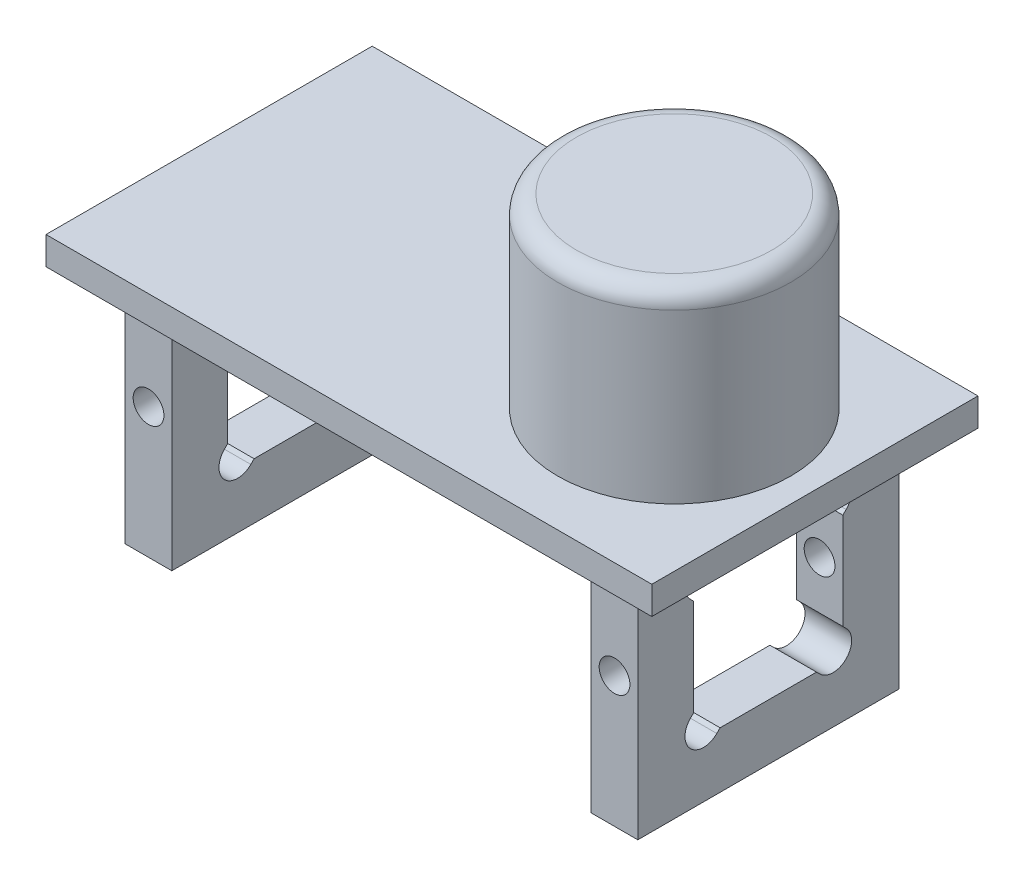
ISO-10303-21;
HEADER;
FILE_DESCRIPTION(('STEP AP214'),'2;1');
FILE_NAME('part.step','',(''),(''),'','','');
FILE_SCHEMA(('AUTOMOTIVE_DESIGN { 1 0 10303 214 1 1 1 1 }'));
ENDSEC;
DATA;
#1=APPLICATION_CONTEXT('core data for automotive mechanical design processes');
#2=APPLICATION_PROTOCOL_DEFINITION('international standard','automotive_design',2000,#1);
#3=PRODUCT_CONTEXT('',#1,'mechanical');
#4=PRODUCT('Part','Part','',(#3));
#5=PRODUCT_RELATED_PRODUCT_CATEGORY('part','',(#4));
#6=PRODUCT_DEFINITION_FORMATION('','',#4);
#7=PRODUCT_DEFINITION_CONTEXT('part definition',#1,'design');
#8=PRODUCT_DEFINITION('design','',#6,#7);
#9=PRODUCT_DEFINITION_SHAPE('','',#8);
#10=(LENGTH_UNIT() NAMED_UNIT(*) SI_UNIT(.MILLI.,.METRE.));
#11=(NAMED_UNIT(*) PLANE_ANGLE_UNIT() SI_UNIT($,.RADIAN.));
#12=(NAMED_UNIT(*) SI_UNIT($,.STERADIAN.) SOLID_ANGLE_UNIT());
#13=UNCERTAINTY_MEASURE_WITH_UNIT(LENGTH_MEASURE(1.E-05),#10,'distance_accuracy_value','');
#14=(GEOMETRIC_REPRESENTATION_CONTEXT(3) GLOBAL_UNCERTAINTY_ASSIGNED_CONTEXT((#13)) GLOBAL_UNIT_ASSIGNED_CONTEXT((#10,
#11,#12)) REPRESENTATION_CONTEXT('',''));
#15=CARTESIAN_POINT('',(0.,0.,0.));
#16=DIRECTION('',(0.,0.,1.));
#17=DIRECTION('',(1.,0.,0.));
#18=AXIS2_PLACEMENT_3D('',#15,#16,#17);
#19=CARTESIAN_POINT('',(0.,0.,17.5));
#20=DIRECTION('',(0.,1.,0.));
#21=DIRECTION('',(0.,0.,1.));
#22=AXIS2_PLACEMENT_3D('',#19,#20,#21);
#23=PLANE('',#22);
#24=DIRECTION('',(0.,0.,-1.));
#25=VECTOR('',#24,1.);
#26=CARTESIAN_POINT('',(10.,0.,-14.));
#27=LINE('',#26,#25);
#28=CARTESIAN_POINT('',(10.,0.,14.));
#29=VERTEX_POINT('',#28);
#30=CARTESIAN_POINT('',(10.,0.,-14.));
#31=VERTEX_POINT('',#30);
#32=EDGE_CURVE('E569',#29,#31,#27,.T.);
#33=ORIENTED_EDGE('',*,*,#32,.T.);
#34=DIRECTION('',(-1.,0.,0.));
#35=VECTOR('',#34,1.);
#36=CARTESIAN_POINT('',(10.,0.,-14.));
#37=LINE('',#36,#35);
#38=CARTESIAN_POINT('',(5.,0.,-14.));
#39=VERTEX_POINT('',#38);
#40=EDGE_CURVE('E582',#31,#39,#37,.T.);
#41=ORIENTED_EDGE('',*,*,#40,.T.);
#42=DIRECTION('',(0.,0.,-1.));
#43=VECTOR('',#42,1.);
#44=CARTESIAN_POINT('',(5.,0.,-14.));
#45=LINE('',#44,#43);
#46=CARTESIAN_POINT('',(5.,0.,14.));
#47=VERTEX_POINT('',#46);
#48=EDGE_CURVE('E564',#47,#39,#45,.T.);
#49=ORIENTED_EDGE('',*,*,#48,.F.);
#50=DIRECTION('',(-1.,0.,0.));
#51=VECTOR('',#50,1.);
#52=CARTESIAN_POINT('',(10.,0.,14.));
#53=LINE('',#52,#51);
#54=EDGE_CURVE('E586',#29,#47,#53,.T.);
#55=ORIENTED_EDGE('',*,*,#54,.F.);
#56=EDGE_LOOP('',(#33,#41,#49,#55));
#57=FACE_BOUND('',#56,.T.);
#58=DIRECTION('',(1.,0.,0.));
#59=VECTOR('',#58,1.);
#60=CARTESIAN_POINT('',(0.,0.,-17.5));
#61=LINE('',#60,#59);
#62=CARTESIAN_POINT('',(0.,0.,-17.5));
#63=VERTEX_POINT('',#62);
#64=CARTESIAN_POINT('',(65.,0.,-17.5));
#65=VERTEX_POINT('',#64);
#66=EDGE_CURVE('E605',#63,#65,#61,.T.);
#67=ORIENTED_EDGE('',*,*,#66,.T.);
#68=DIRECTION('',(0.,0.,-1.));
#69=VECTOR('',#68,1.);
#70=CARTESIAN_POINT('',(65.,0.,17.5));
#71=LINE('',#70,#69);
#72=CARTESIAN_POINT('',(65.,0.,17.5));
#73=VERTEX_POINT('',#72);
#74=EDGE_CURVE('E615',#73,#65,#71,.T.);
#75=ORIENTED_EDGE('',*,*,#74,.F.);
#76=DIRECTION('',(1.,0.,0.));
#77=VECTOR('',#76,1.);
#78=CARTESIAN_POINT('',(0.,0.,17.5));
#79=LINE('',#78,#77);
#80=CARTESIAN_POINT('',(0.,0.,17.5));
#81=VERTEX_POINT('',#80);
#82=EDGE_CURVE('E595',#81,#73,#79,.T.);
#83=ORIENTED_EDGE('',*,*,#82,.F.);
#84=DIRECTION('',(0.,0.,-1.));
#85=VECTOR('',#84,1.);
#86=CARTESIAN_POINT('',(0.,0.,17.5));
#87=LINE('',#86,#85);
#88=EDGE_CURVE('E618',#81,#63,#87,.T.);
#89=ORIENTED_EDGE('',*,*,#88,.T.);
#90=EDGE_LOOP('',(#67,#75,#83,#89));
#91=FACE_BOUND('',#90,.T.);
#92=DIRECTION('',(0.,0.,-1.));
#93=VECTOR('',#92,1.);
#94=CARTESIAN_POINT('',(60.,0.,-14.));
#95=LINE('',#94,#93);
#96=CARTESIAN_POINT('',(60.,0.,14.));
#97=VERTEX_POINT('',#96);
#98=CARTESIAN_POINT('',(60.,0.,-14.));
#99=VERTEX_POINT('',#98);
#100=EDGE_CURVE('E515',#97,#99,#95,.T.);
#101=ORIENTED_EDGE('',*,*,#100,.T.);
#102=DIRECTION('',(-1.,0.,0.));
#103=VECTOR('',#102,1.);
#104=CARTESIAN_POINT('',(60.,0.,-14.));
#105=LINE('',#104,#103);
#106=CARTESIAN_POINT('',(55.,0.,-14.));
#107=VERTEX_POINT('',#106);
#108=EDGE_CURVE('E528',#99,#107,#105,.T.);
#109=ORIENTED_EDGE('',*,*,#108,.T.);
#110=DIRECTION('',(0.,0.,-1.));
#111=VECTOR('',#110,1.);
#112=CARTESIAN_POINT('',(55.,0.,-14.));
#113=LINE('',#112,#111);
#114=CARTESIAN_POINT('',(55.,0.,14.));
#115=VERTEX_POINT('',#114);
#116=EDGE_CURVE('E510',#115,#107,#113,.T.);
#117=ORIENTED_EDGE('',*,*,#116,.F.);
#118=DIRECTION('',(-1.,0.,0.));
#119=VECTOR('',#118,1.);
#120=CARTESIAN_POINT('',(60.,0.,14.));
#121=LINE('',#120,#119);
#122=EDGE_CURVE('E532',#97,#115,#121,.T.);
#123=ORIENTED_EDGE('',*,*,#122,.F.);
#124=EDGE_LOOP('',(#101,#109,#117,#123));
#125=FACE_BOUND('',#124,.T.);
#126=ADVANCED_FACE('F33',(#57,#91,#125),#23,.F.);
#127=CARTESIAN_POINT('',(0.,3.,17.5));
#128=DIRECTION('',(0.,-1.,0.));
#129=DIRECTION('',(0.,0.,-1.));
#130=AXIS2_PLACEMENT_3D('',#127,#128,#129);
#131=PLANE('',#130);
#132=DIRECTION('',(-1.,0.,0.));
#133=VECTOR('',#132,1.);
#134=CARTESIAN_POINT('',(0.,3.,-17.5));
#135=LINE('',#134,#133);
#136=CARTESIAN_POINT('',(65.,3.,-17.5));
#137=VERTEX_POINT('',#136);
#138=CARTESIAN_POINT('',(0.,3.,-17.5));
#139=VERTEX_POINT('',#138);
#140=EDGE_CURVE('E596',#137,#139,#135,.T.);
#141=ORIENTED_EDGE('',*,*,#140,.T.);
#142=DIRECTION('',(0.,0.,-1.));
#143=VECTOR('',#142,1.);
#144=CARTESIAN_POINT('',(0.,3.,17.5));
#145=LINE('',#144,#143);
#146=CARTESIAN_POINT('',(0.,3.,17.5));
#147=VERTEX_POINT('',#146);
#148=EDGE_CURVE('E602',#147,#139,#145,.T.);
#149=ORIENTED_EDGE('',*,*,#148,.F.);
#150=DIRECTION('',(-1.,0.,0.));
#151=VECTOR('',#150,1.);
#152=CARTESIAN_POINT('',(0.,3.,17.5));
#153=LINE('',#152,#151);
#154=CARTESIAN_POINT('',(65.,3.,17.5));
#155=VERTEX_POINT('',#154);
#156=EDGE_CURVE('E600',#155,#147,#153,.T.);
#157=ORIENTED_EDGE('',*,*,#156,.F.);
#158=DIRECTION('',(0.,0.,-1.));
#159=VECTOR('',#158,1.);
#160=CARTESIAN_POINT('',(65.,3.,17.5));
#161=LINE('',#160,#159);
#162=EDGE_CURVE('E612',#155,#137,#161,.T.);
#163=ORIENTED_EDGE('',*,*,#162,.T.);
#164=EDGE_LOOP('',(#141,#149,#157,#163));
#165=FACE_BOUND('',#164,.T.);
#166=CARTESIAN_POINT('',(49.9073159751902,3.,0.));
#167=DIRECTION('',(0.,-1.,0.));
#168=DIRECTION('',(0.,0.,-1.));
#169=AXIS2_PLACEMENT_3D('',#166,#167,#168);
#170=CIRCLE('',#169,12.5);
#171=CARTESIAN_POINT('',(49.9073159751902,3.,-12.5));
#172=VERTEX_POINT('',#171);
#173=EDGE_CURVE('E621',#172,#172,#170,.F.);
#174=ORIENTED_EDGE('',*,*,#173,.F.);
#175=EDGE_LOOP('',(#174));
#176=FACE_BOUND('',#175,.T.);
#177=ADVANCED_FACE('F683',(#165,#176),#131,.F.);
#178=CARTESIAN_POINT('',(0.,0.,17.5));
#179=DIRECTION('',(1.,0.,0.));
#180=DIRECTION('',(0.,0.,-1.));
#181=AXIS2_PLACEMENT_3D('',#178,#179,#180);
#182=PLANE('',#181);
#183=DIRECTION('',(0.,-1.,0.));
#184=VECTOR('',#183,1.);
#185=CARTESIAN_POINT('',(0.,0.,-17.5));
#186=LINE('',#185,#184);
#187=EDGE_CURVE('E585',#139,#63,#186,.T.);
#188=ORIENTED_EDGE('',*,*,#187,.T.);
#189=ORIENTED_EDGE('',*,*,#88,.F.);
#190=DIRECTION('',(0.,-1.,0.));
#191=VECTOR('',#190,1.);
#192=CARTESIAN_POINT('',(0.,0.,17.5));
#193=LINE('',#192,#191);
#194=EDGE_CURVE('E592',#147,#81,#193,.T.);
#195=ORIENTED_EDGE('',*,*,#194,.F.);
#196=ORIENTED_EDGE('',*,*,#148,.T.);
#197=EDGE_LOOP('',(#188,#189,#195,#196));
#198=FACE_BOUND('',#197,.T.);
#199=ADVANCED_FACE('F689',(#198),#182,.F.);
#200=CARTESIAN_POINT('',(65.,0.,17.5));
#201=DIRECTION('',(-1.,0.,0.));
#202=DIRECTION('',(0.,0.,1.));
#203=AXIS2_PLACEMENT_3D('',#200,#201,#202);
#204=PLANE('',#203);
#205=DIRECTION('',(0.,1.,0.));
#206=VECTOR('',#205,1.);
#207=CARTESIAN_POINT('',(65.,0.,-17.5));
#208=LINE('',#207,#206);
#209=EDGE_CURVE('E607',#65,#137,#208,.T.);
#210=ORIENTED_EDGE('',*,*,#209,.T.);
#211=ORIENTED_EDGE('',*,*,#162,.F.);
#212=DIRECTION('',(0.,1.,0.));
#213=VECTOR('',#212,1.);
#214=CARTESIAN_POINT('',(65.,0.,17.5));
#215=LINE('',#214,#213);
#216=EDGE_CURVE('E598',#73,#155,#215,.T.);
#217=ORIENTED_EDGE('',*,*,#216,.F.);
#218=ORIENTED_EDGE('',*,*,#74,.T.);
#219=EDGE_LOOP('',(#210,#211,#217,#218));
#220=FACE_BOUND('',#219,.T.);
#221=ADVANCED_FACE('F694',(#220),#204,.F.);
#222=CARTESIAN_POINT('',(0.,3.,17.5));
#223=DIRECTION('',(0.,0.,-1.));
#224=DIRECTION('',(-1.,0.,0.));
#225=AXIS2_PLACEMENT_3D('',#222,#223,#224);
#226=PLANE('',#225);
#227=ORIENTED_EDGE('',*,*,#194,.T.);
#228=ORIENTED_EDGE('',*,*,#82,.T.);
#229=ORIENTED_EDGE('',*,*,#216,.T.);
#230=ORIENTED_EDGE('',*,*,#156,.T.);
#231=EDGE_LOOP('',(#227,#228,#229,#230));
#232=FACE_BOUND('',#231,.T.);
#233=ADVANCED_FACE('F700',(#232),#226,.F.);
#234=CARTESIAN_POINT('',(0.,3.,-17.5));
#235=DIRECTION('',(0.,0.,-1.));
#236=DIRECTION('',(-1.,0.,0.));
#237=AXIS2_PLACEMENT_3D('',#234,#235,#236);
#238=PLANE('',#237);
#239=ORIENTED_EDGE('',*,*,#187,.F.);
#240=ORIENTED_EDGE('',*,*,#140,.F.);
#241=ORIENTED_EDGE('',*,*,#209,.F.);
#242=ORIENTED_EDGE('',*,*,#66,.F.);
#243=EDGE_LOOP('',(#239,#240,#241,#242));
#244=FACE_BOUND('',#243,.T.);
#245=ADVANCED_FACE('F708',(#244),#238,.T.);
#246=CARTESIAN_POINT('',(49.9073159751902,23.,0.));
#247=DIRECTION('',(0.,-1.,0.));
#248=DIRECTION('',(0.,0.,-1.));
#249=AXIS2_PLACEMENT_3D('',#246,#247,#248);
#250=CYLINDRICAL_SURFACE('',#249,12.5);
#251=CARTESIAN_POINT('',(49.9073159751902,21.,0.));
#252=DIRECTION('',(0.,1.,0.));
#253=DIRECTION('',(0.,0.,1.));
#254=AXIS2_PLACEMENT_3D('',#251,#252,#253);
#255=CIRCLE('',#254,12.5);
#256=CARTESIAN_POINT('',(49.9073159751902,21.,12.5));
#257=VERTEX_POINT('',#256);
#258=EDGE_CURVE('E627',#257,#257,#255,.F.);
#259=ORIENTED_EDGE('',*,*,#258,.T.);
#260=EDGE_LOOP('',(#259));
#261=FACE_BOUND('',#260,.T.);
#262=ORIENTED_EDGE('',*,*,#173,.T.);
#263=EDGE_LOOP('',(#262));
#264=FACE_BOUND('',#263,.T.);
#265=ADVANCED_FACE('F719',(#261,#264),#250,.T.);
#266=CARTESIAN_POINT('',(49.9073159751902,23.,0.));
#267=DIRECTION('',(0.,1.,0.));
#268=DIRECTION('',(0.,0.,1.));
#269=AXIS2_PLACEMENT_3D('',#266,#267,#268);
#270=PLANE('',#269);
#271=CARTESIAN_POINT('',(49.9073159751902,23.,0.));
#272=DIRECTION('',(0.,1.,0.));
#273=DIRECTION('',(0.,0.,1.));
#274=AXIS2_PLACEMENT_3D('',#271,#272,#273);
#275=CIRCLE('',#274,10.5);
#276=CARTESIAN_POINT('',(49.9073159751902,23.,10.5));
#277=VERTEX_POINT('',#276);
#278=EDGE_CURVE('E624',#277,#277,#275,.T.);
#279=ORIENTED_EDGE('',*,*,#278,.T.);
#280=EDGE_LOOP('',(#279));
#281=FACE_BOUND('',#280,.T.);
#282=ADVANCED_FACE('F721',(#281),#270,.T.);
#283=CARTESIAN_POINT('',(10.,0.,-14.));
#284=DIRECTION('',(0.,0.,-1.));
#285=DIRECTION('',(0.,1.,0.));
#286=AXIS2_PLACEMENT_3D('',#283,#284,#285);
#287=PLANE('',#286);
#288=CARTESIAN_POINT('',(7.5,-11.,-14.));
#289=DIRECTION('',(0.,0.,-1.));
#290=DIRECTION('',(0.,1.,0.));
#291=AXIS2_PLACEMENT_3D('',#288,#289,#290);
#292=CIRCLE('',#291,1.64999999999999);
#293=CARTESIAN_POINT('',(7.5,-9.35000000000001,-14.));
#294=VERTEX_POINT('',#293);
#295=EDGE_CURVE('E645',#294,#294,#292,.T.);
#296=ORIENTED_EDGE('',*,*,#295,.F.);
#297=EDGE_LOOP('',(#296));
#298=FACE_BOUND('',#297,.T.);
#299=DIRECTION('',(0.,-1.,0.));
#300=VECTOR('',#299,1.);
#301=CARTESIAN_POINT('',(5.,0.,-14.));
#302=LINE('',#301,#300);
#303=CARTESIAN_POINT('',(5.,-25.,-14.));
#304=VERTEX_POINT('',#303);
#305=EDGE_CURVE('E550',#39,#304,#302,.T.);
#306=ORIENTED_EDGE('',*,*,#305,.F.);
#307=ORIENTED_EDGE('',*,*,#40,.F.);
#308=DIRECTION('',(0.,-1.,0.));
#309=VECTOR('',#308,1.);
#310=CARTESIAN_POINT('',(10.,0.,-14.));
#311=LINE('',#310,#309);
#312=CARTESIAN_POINT('',(10.,-25.,-14.));
#313=VERTEX_POINT('',#312);
#314=EDGE_CURVE('E560',#31,#313,#311,.T.);
#315=ORIENTED_EDGE('',*,*,#314,.T.);
#316=DIRECTION('',(-1.,0.,0.));
#317=VECTOR('',#316,1.);
#318=CARTESIAN_POINT('',(10.,-25.,-14.));
#319=LINE('',#318,#317);
#320=EDGE_CURVE('E572',#313,#304,#319,.T.);
#321=ORIENTED_EDGE('',*,*,#320,.T.);
#322=EDGE_LOOP('',(#306,#307,#315,#321));
#323=FACE_BOUND('',#322,.T.);
#324=ADVANCED_FACE('F728',(#298,#323),#287,.T.);
#325=CARTESIAN_POINT('',(10.,0.,14.));
#326=DIRECTION('',(0.,0.,1.));
#327=DIRECTION('',(0.,-1.,0.));
#328=AXIS2_PLACEMENT_3D('',#325,#326,#327);
#329=PLANE('',#328);
#330=CARTESIAN_POINT('',(7.5,-11.,14.));
#331=DIRECTION('',(0.,0.,1.));
#332=DIRECTION('',(1.,0.,0.));
#333=AXIS2_PLACEMENT_3D('',#330,#331,#332);
#334=CIRCLE('',#333,1.64999999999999);
#335=CARTESIAN_POINT('',(9.14999999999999,-11.,14.));
#336=VERTEX_POINT('',#335);
#337=EDGE_CURVE('E648',#336,#336,#334,.T.);
#338=ORIENTED_EDGE('',*,*,#337,.F.);
#339=EDGE_LOOP('',(#338));
#340=FACE_BOUND('',#339,.T.);
#341=DIRECTION('',(0.,1.,0.));
#342=VECTOR('',#341,1.);
#343=CARTESIAN_POINT('',(5.,0.,14.));
#344=LINE('',#343,#342);
#345=CARTESIAN_POINT('',(5.,-25.,14.));
#346=VERTEX_POINT('',#345);
#347=EDGE_CURVE('E578',#346,#47,#344,.T.);
#348=ORIENTED_EDGE('',*,*,#347,.F.);
#349=DIRECTION('',(-1.,0.,0.));
#350=VECTOR('',#349,1.);
#351=CARTESIAN_POINT('',(10.,-25.,14.));
#352=LINE('',#351,#350);
#353=CARTESIAN_POINT('',(10.,-25.,14.));
#354=VERTEX_POINT('',#353);
#355=EDGE_CURVE('E589',#354,#346,#352,.T.);
#356=ORIENTED_EDGE('',*,*,#355,.F.);
#357=DIRECTION('',(0.,1.,0.));
#358=VECTOR('',#357,1.);
#359=CARTESIAN_POINT('',(10.,0.,14.));
#360=LINE('',#359,#358);
#361=EDGE_CURVE('E567',#354,#29,#360,.T.);
#362=ORIENTED_EDGE('',*,*,#361,.T.);
#363=ORIENTED_EDGE('',*,*,#54,.T.);
#364=EDGE_LOOP('',(#348,#356,#362,#363));
#365=FACE_BOUND('',#364,.T.);
#366=ADVANCED_FACE('F764',(#340,#365),#329,.T.);
#367=CARTESIAN_POINT('',(10.,-25.,-14.));
#368=DIRECTION('',(0.,-1.,0.));
#369=DIRECTION('',(0.,0.,-1.));
#370=AXIS2_PLACEMENT_3D('',#367,#368,#369);
#371=PLANE('',#370);
#372=DIRECTION('',(0.,0.,1.));
#373=VECTOR('',#372,1.);
#374=CARTESIAN_POINT('',(5.,-25.,-14.));
#375=LINE('',#374,#373);
#376=EDGE_CURVE('E575',#304,#346,#375,.T.);
#377=ORIENTED_EDGE('',*,*,#376,.F.);
#378=ORIENTED_EDGE('',*,*,#320,.F.);
#379=DIRECTION('',(0.,0.,1.));
#380=VECTOR('',#379,1.);
#381=CARTESIAN_POINT('',(10.,-25.,-14.));
#382=LINE('',#381,#380);
#383=EDGE_CURVE('E563',#313,#354,#382,.T.);
#384=ORIENTED_EDGE('',*,*,#383,.T.);
#385=ORIENTED_EDGE('',*,*,#355,.T.);
#386=EDGE_LOOP('',(#377,#378,#384,#385));
#387=FACE_BOUND('',#386,.T.);
#388=ADVANCED_FACE('F774',(#387),#371,.T.);
#389=CARTESIAN_POINT('',(10.,-25.,-14.));
#390=DIRECTION('',(-1.,0.,0.));
#391=DIRECTION('',(0.,0.,1.));
#392=AXIS2_PLACEMENT_3D('',#389,#390,#391);
#393=PLANE('',#392);
#394=CARTESIAN_POINT('',(10.,-17.9393398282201,6.93933982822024));
#395=DIRECTION('',(-1.,0.,0.));
#396=DIRECTION('',(0.,0.,1.));
#397=AXIS2_PLACEMENT_3D('',#394,#395,#396);
#398=CIRCLE('',#397,1.99999999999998);
#399=CARTESIAN_POINT('',(10.,-19.3535533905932,5.52512626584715));
#400=VERTEX_POINT('',#399);
#401=CARTESIAN_POINT('',(10.,-16.525126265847,8.3535533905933));
#402=VERTEX_POINT('',#401);
#403=EDGE_CURVE('E364',#400,#402,#398,.T.);
#404=ORIENTED_EDGE('',*,*,#403,.T.);
#405=DIRECTION('',(0.,0.707106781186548,-0.707106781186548));
#406=VECTOR('',#405,1.);
#407=CARTESIAN_POINT('',(10.,-9.58578643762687,1.41421356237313));
#408=LINE('',#407,#406);
#409=CARTESIAN_POINT('',(10.,-16.1715728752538,8.00000000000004));
#410=VERTEX_POINT('',#409);
#411=EDGE_CURVE('E359',#402,#410,#408,.T.);
#412=ORIENTED_EDGE('',*,*,#411,.T.);
#413=DIRECTION('',(0.,1.,0.));
#414=VECTOR('',#413,1.);
#415=CARTESIAN_POINT('',(10.,-3.,8.));
#416=LINE('',#415,#414);
#417=CARTESIAN_POINT('',(10.,-5.82842712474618,8.));
#418=VERTEX_POINT('',#417);
#419=EDGE_CURVE('E545',#410,#418,#416,.T.);
#420=ORIENTED_EDGE('',*,*,#419,.T.);
#421=DIRECTION('',(0.,0.707106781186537,0.707106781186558));
#422=VECTOR('',#421,1.);
#423=CARTESIAN_POINT('',(10.,-26.4142135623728,-12.5857864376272));
#424=LINE('',#423,#422);
#425=CARTESIAN_POINT('',(10.,-5.47487373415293,8.35355339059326));
#426=VERTEX_POINT('',#425);
#427=EDGE_CURVE('E470',#418,#426,#424,.T.);
#428=ORIENTED_EDGE('',*,*,#427,.T.);
#429=CARTESIAN_POINT('',(10.,-4.06066017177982,6.93933982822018));
#430=DIRECTION('',(-1.,0.,0.));
#431=DIRECTION('',(0.,0.,1.));
#432=AXIS2_PLACEMENT_3D('',#429,#430,#431);
#433=CIRCLE('',#432,1.99999999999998);
#434=CARTESIAN_POINT('',(10.,-2.64644660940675,5.52512626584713));
#435=VERTEX_POINT('',#434);
#436=EDGE_CURVE('E482',#426,#435,#433,.T.);
#437=ORIENTED_EDGE('',*,*,#436,.T.);
#438=DIRECTION('',(0.,-0.707106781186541,-0.707106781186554));
#439=VECTOR('',#438,1.);
#440=CARTESIAN_POINT('',(10.,-23.5857864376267,-15.4142135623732));
#441=LINE('',#440,#439);
#442=CARTESIAN_POINT('',(10.,-3.,5.17157287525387));
#443=VERTEX_POINT('',#442);
#444=EDGE_CURVE('E477',#435,#443,#441,.T.);
#445=ORIENTED_EDGE('',*,*,#444,.T.);
#446=DIRECTION('',(0.,0.,-1.));
#447=VECTOR('',#446,1.);
#448=CARTESIAN_POINT('',(10.,-3.,-8.));
#449=LINE('',#448,#447);
#450=CARTESIAN_POINT('',(10.,-3.,-5.17157287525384));
#451=VERTEX_POINT('',#450);
#452=EDGE_CURVE('E547',#443,#451,#449,.T.);
#453=ORIENTED_EDGE('',*,*,#452,.T.);
#454=DIRECTION('',(0.,0.707106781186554,-0.707106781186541));
#455=VECTOR('',#454,1.);
#456=CARTESIAN_POINT('',(10.,-9.58578643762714,1.41421356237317));
#457=LINE('',#456,#455);
#458=CARTESIAN_POINT('',(10.,-2.64644660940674,-5.52512626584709));
#459=VERTEX_POINT('',#458);
#460=EDGE_CURVE('E430',#451,#459,#457,.T.);
#461=ORIENTED_EDGE('',*,*,#460,.T.);
#462=CARTESIAN_POINT('',(10.,-4.06066017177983,-6.93933982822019));
#463=DIRECTION('',(-1.,0.,0.));
#464=DIRECTION('',(0.,0.,1.));
#465=AXIS2_PLACEMENT_3D('',#462,#463,#464);
#466=CIRCLE('',#465,1.99999999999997);
#467=CARTESIAN_POINT('',(10.,-5.47487373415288,-8.35355339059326));
#468=VERTEX_POINT('',#467);
#469=EDGE_CURVE('E442',#459,#468,#466,.T.);
#470=ORIENTED_EDGE('',*,*,#469,.T.);
#471=DIRECTION('',(0.,-0.707106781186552,0.707106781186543));
#472=VECTOR('',#471,1.);
#473=CARTESIAN_POINT('',(10.,-12.4142135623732,-1.41421356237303));
#474=LINE('',#473,#472);
#475=CARTESIAN_POINT('',(10.,-5.82842712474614,-8.00000000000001));
#476=VERTEX_POINT('',#475);
#477=EDGE_CURVE('E437',#468,#476,#474,.T.);
#478=ORIENTED_EDGE('',*,*,#477,.T.);
#479=DIRECTION('',(0.,-1.,0.));
#480=VECTOR('',#479,1.);
#481=CARTESIAN_POINT('',(10.,-3.,-8.));
#482=LINE('',#481,#480);
#483=CARTESIAN_POINT('',(10.,-16.1715728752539,-7.99999999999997));
#484=VERTEX_POINT('',#483);
#485=EDGE_CURVE('E538',#476,#484,#482,.T.);
#486=ORIENTED_EDGE('',*,*,#485,.T.);
#487=DIRECTION('',(0.,-0.707106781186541,-0.707106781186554));
#488=VECTOR('',#487,1.);
#489=CARTESIAN_POINT('',(10.,-23.5857864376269,-15.4142135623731));
#490=LINE('',#489,#488);
#491=CARTESIAN_POINT('',(10.,-16.5251262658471,-8.35355339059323));
#492=VERTEX_POINT('',#491);
#493=EDGE_CURVE('E398',#484,#492,#490,.T.);
#494=ORIENTED_EDGE('',*,*,#493,.T.);
#495=CARTESIAN_POINT('',(10.,-17.9393398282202,-6.93933982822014));
#496=DIRECTION('',(-1.,0.,0.));
#497=DIRECTION('',(0.,0.,1.));
#498=AXIS2_PLACEMENT_3D('',#495,#496,#497);
#499=CIRCLE('',#498,1.99999999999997);
#500=CARTESIAN_POINT('',(10.,-19.3535533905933,-5.52512626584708));
#501=VERTEX_POINT('',#500);
#502=EDGE_CURVE('E403',#492,#501,#499,.T.);
#503=ORIENTED_EDGE('',*,*,#502,.T.);
#504=DIRECTION('',(0.,0.707106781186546,0.707106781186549));
#505=VECTOR('',#504,1.);
#506=CARTESIAN_POINT('',(10.,-26.4142135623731,-12.5857864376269));
#507=LINE('',#506,#505);
#508=CARTESIAN_POINT('',(10.,-19.,-5.17157287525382));
#509=VERTEX_POINT('',#508);
#510=EDGE_CURVE('E391',#501,#509,#507,.T.);
#511=ORIENTED_EDGE('',*,*,#510,.T.);
#512=DIRECTION('',(0.,0.,1.));
#513=VECTOR('',#512,1.);
#514=CARTESIAN_POINT('',(10.,-19.,-8.));
#515=LINE('',#514,#513);
#516=CARTESIAN_POINT('',(10.,-19.,5.17157287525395));
#517=VERTEX_POINT('',#516);
#518=EDGE_CURVE('E541',#509,#517,#515,.T.);
#519=ORIENTED_EDGE('',*,*,#518,.T.);
#520=DIRECTION('',(0.,-0.707106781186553,0.707106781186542));
#521=VECTOR('',#520,1.);
#522=CARTESIAN_POINT('',(10.,-12.4142135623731,-1.41421356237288));
#523=LINE('',#522,#521);
#524=EDGE_CURVE('E50',#517,#400,#523,.T.);
#525=ORIENTED_EDGE('',*,*,#524,.T.);
#526=EDGE_LOOP('',(#404,#412,#420,#428,#437,#445,#453,#461,#470,#478,#486,#494,#503,#511,#519,#525));
#527=FACE_BOUND('',#526,.T.);
#528=ORIENTED_EDGE('',*,*,#314,.F.);
#529=ORIENTED_EDGE('',*,*,#32,.F.);
#530=ORIENTED_EDGE('',*,*,#361,.F.);
#531=ORIENTED_EDGE('',*,*,#383,.F.);
#532=EDGE_LOOP('',(#528,#529,#530,#531));
#533=FACE_BOUND('',#532,.T.);
#534=ADVANCED_FACE('F785',(#527,#533),#393,.F.);
#535=CARTESIAN_POINT('',(5.,-25.,-14.));
#536=DIRECTION('',(-1.,0.,0.));
#537=DIRECTION('',(0.,0.,1.));
#538=AXIS2_PLACEMENT_3D('',#535,#536,#537);
#539=PLANE('',#538);
#540=DIRECTION('',(0.,0.707106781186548,-0.707106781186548));
#541=VECTOR('',#540,1.);
#542=CARTESIAN_POINT('',(5.,-9.58578643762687,1.41421356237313));
#543=LINE('',#542,#541);
#544=CARTESIAN_POINT('',(5.,-16.525126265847,8.3535533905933));
#545=VERTEX_POINT('',#544);
#546=CARTESIAN_POINT('',(5.,-16.1715728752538,8.00000000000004));
#547=VERTEX_POINT('',#546);
#548=EDGE_CURVE('E357',#545,#547,#543,.T.);
#549=ORIENTED_EDGE('',*,*,#548,.F.);
#550=CARTESIAN_POINT('',(5.,-17.9393398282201,6.93933982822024));
#551=DIRECTION('',(-1.,0.,0.));
#552=DIRECTION('',(0.,0.,1.));
#553=AXIS2_PLACEMENT_3D('',#550,#551,#552);
#554=CIRCLE('',#553,1.99999999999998);
#555=CARTESIAN_POINT('',(5.,-19.3535533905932,5.52512626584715));
#556=VERTEX_POINT('',#555);
#557=EDGE_CURVE('E362',#556,#545,#554,.T.);
#558=ORIENTED_EDGE('',*,*,#557,.F.);
#559=DIRECTION('',(0.,-0.707106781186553,0.707106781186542));
#560=VECTOR('',#559,1.);
#561=CARTESIAN_POINT('',(5.,-12.4142135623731,-1.41421356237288));
#562=LINE('',#561,#560);
#563=CARTESIAN_POINT('',(5.,-18.9999999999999,5.17157287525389));
#564=VERTEX_POINT('',#563);
#565=EDGE_CURVE('E352',#564,#556,#562,.T.);
#566=ORIENTED_EDGE('',*,*,#565,.F.);
#567=DIRECTION('',(0.,0.,1.));
#568=VECTOR('',#567,1.);
#569=CARTESIAN_POINT('',(5.,-19.,-8.));
#570=LINE('',#569,#568);
#571=CARTESIAN_POINT('',(5.,-19.,-5.17157287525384));
#572=VERTEX_POINT('',#571);
#573=EDGE_CURVE('E553',#572,#564,#570,.T.);
#574=ORIENTED_EDGE('',*,*,#573,.F.);
#575=DIRECTION('',(0.,0.707106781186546,0.707106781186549));
#576=VECTOR('',#575,1.);
#577=CARTESIAN_POINT('',(5.,-26.4142135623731,-12.5857864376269));
#578=LINE('',#577,#576);
#579=CARTESIAN_POINT('',(5.,-19.3535533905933,-5.52512626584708));
#580=VERTEX_POINT('',#579);
#581=EDGE_CURVE('E389',#580,#572,#578,.T.);
#582=ORIENTED_EDGE('',*,*,#581,.F.);
#583=CARTESIAN_POINT('',(5.,-17.9393398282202,-6.93933982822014));
#584=DIRECTION('',(-1.,0.,0.));
#585=DIRECTION('',(0.,0.,1.));
#586=AXIS2_PLACEMENT_3D('',#583,#584,#585);
#587=CIRCLE('',#586,1.99999999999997);
#588=CARTESIAN_POINT('',(5.,-16.5251262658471,-8.35355339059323));
#589=VERTEX_POINT('',#588);
#590=EDGE_CURVE('E401',#589,#580,#587,.T.);
#591=ORIENTED_EDGE('',*,*,#590,.F.);
#592=DIRECTION('',(0.,-0.707106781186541,-0.707106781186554));
#593=VECTOR('',#592,1.);
#594=CARTESIAN_POINT('',(5.,-23.5857864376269,-15.4142135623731));
#595=LINE('',#594,#593);
#596=CARTESIAN_POINT('',(5.,-16.1715728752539,-7.99999999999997));
#597=VERTEX_POINT('',#596);
#598=EDGE_CURVE('E396',#597,#589,#595,.T.);
#599=ORIENTED_EDGE('',*,*,#598,.F.);
#600=DIRECTION('',(0.,-1.,0.));
#601=VECTOR('',#600,1.);
#602=CARTESIAN_POINT('',(5.,-3.,-8.));
#603=LINE('',#602,#601);
#604=CARTESIAN_POINT('',(5.,-5.82842712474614,-8.00000000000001));
#605=VERTEX_POINT('',#604);
#606=EDGE_CURVE('E531',#605,#597,#603,.T.);
#607=ORIENTED_EDGE('',*,*,#606,.F.);
#608=DIRECTION('',(0.,-0.707106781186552,0.707106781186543));
#609=VECTOR('',#608,1.);
#610=CARTESIAN_POINT('',(5.,-12.4142135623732,-1.41421356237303));
#611=LINE('',#610,#609);
#612=CARTESIAN_POINT('',(5.,-5.47487373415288,-8.35355339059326));
#613=VERTEX_POINT('',#612);
#614=EDGE_CURVE('E435',#613,#605,#611,.T.);
#615=ORIENTED_EDGE('',*,*,#614,.F.);
#616=CARTESIAN_POINT('',(5.,-4.06066017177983,-6.93933982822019));
#617=DIRECTION('',(-1.,0.,0.));
#618=DIRECTION('',(0.,0.,1.));
#619=AXIS2_PLACEMENT_3D('',#616,#617,#618);
#620=CIRCLE('',#619,1.99999999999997);
#621=CARTESIAN_POINT('',(5.,-2.64644660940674,-5.52512626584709));
#622=VERTEX_POINT('',#621);
#623=EDGE_CURVE('E440',#622,#613,#620,.T.);
#624=ORIENTED_EDGE('',*,*,#623,.F.);
#625=DIRECTION('',(0.,0.707106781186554,-0.707106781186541));
#626=VECTOR('',#625,1.);
#627=CARTESIAN_POINT('',(5.,-9.58578643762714,1.41421356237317));
#628=LINE('',#627,#626);
#629=CARTESIAN_POINT('',(5.,-3.,-5.17157287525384));
#630=VERTEX_POINT('',#629);
#631=EDGE_CURVE('E428',#630,#622,#628,.T.);
#632=ORIENTED_EDGE('',*,*,#631,.F.);
#633=DIRECTION('',(0.,0.,-1.));
#634=VECTOR('',#633,1.);
#635=CARTESIAN_POINT('',(5.,-3.,-8.));
#636=LINE('',#635,#634);
#637=CARTESIAN_POINT('',(5.,-3.,5.17157287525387));
#638=VERTEX_POINT('',#637);
#639=EDGE_CURVE('E542',#638,#630,#636,.T.);
#640=ORIENTED_EDGE('',*,*,#639,.F.);
#641=DIRECTION('',(0.,-0.707106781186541,-0.707106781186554));
#642=VECTOR('',#641,1.);
#643=CARTESIAN_POINT('',(5.,-23.5857864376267,-15.4142135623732));
#644=LINE('',#643,#642);
#645=CARTESIAN_POINT('',(5.,-2.64644660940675,5.52512626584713));
#646=VERTEX_POINT('',#645);
#647=EDGE_CURVE('E475',#646,#638,#644,.T.);
#648=ORIENTED_EDGE('',*,*,#647,.F.);
#649=CARTESIAN_POINT('',(5.,-4.06066017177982,6.93933982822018));
#650=DIRECTION('',(-1.,0.,0.));
#651=DIRECTION('',(0.,0.,1.));
#652=AXIS2_PLACEMENT_3D('',#649,#650,#651);
#653=CIRCLE('',#652,1.99999999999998);
#654=CARTESIAN_POINT('',(5.,-5.47487373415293,8.35355339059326));
#655=VERTEX_POINT('',#654);
#656=EDGE_CURVE('E480',#655,#646,#653,.T.);
#657=ORIENTED_EDGE('',*,*,#656,.F.);
#658=DIRECTION('',(0.,0.707106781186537,0.707106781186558));
#659=VECTOR('',#658,1.);
#660=CARTESIAN_POINT('',(5.,-26.4142135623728,-12.5857864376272));
#661=LINE('',#660,#659);
#662=CARTESIAN_POINT('',(5.,-5.82842712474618,8.));
#663=VERTEX_POINT('',#662);
#664=EDGE_CURVE('E468',#663,#655,#661,.T.);
#665=ORIENTED_EDGE('',*,*,#664,.F.);
#666=DIRECTION('',(0.,1.,0.));
#667=VECTOR('',#666,1.);
#668=CARTESIAN_POINT('',(5.,-3.,8.));
#669=LINE('',#668,#667);
#670=EDGE_CURVE('E556',#547,#663,#669,.T.);
#671=ORIENTED_EDGE('',*,*,#670,.F.);
#672=EDGE_LOOP('',(#549,#558,#566,#574,#582,#591,#599,#607,#615,#624,#632,#640,#648,#657,#665,#671));
#673=FACE_BOUND('',#672,.T.);
#674=ORIENTED_EDGE('',*,*,#305,.T.);
#675=ORIENTED_EDGE('',*,*,#376,.T.);
#676=ORIENTED_EDGE('',*,*,#347,.T.);
#677=ORIENTED_EDGE('',*,*,#48,.T.);
#678=EDGE_LOOP('',(#674,#675,#676,#677));
#679=FACE_BOUND('',#678,.T.);
#680=ADVANCED_FACE('F793',(#673,#679),#539,.T.);
#681=CARTESIAN_POINT('',(10.,-3.,-8.));
#682=DIRECTION('',(0.,0.,-1.));
#683=DIRECTION('',(0.,1.,0.));
#684=AXIS2_PLACEMENT_3D('',#681,#682,#683);
#685=PLANE('',#684);
#686=CARTESIAN_POINT('',(7.5,-11.,-8.));
#687=DIRECTION('',(0.,0.,-1.));
#688=DIRECTION('',(0.,1.,0.));
#689=AXIS2_PLACEMENT_3D('',#686,#687,#688);
#690=CIRCLE('',#689,1.64999999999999);
#691=CARTESIAN_POINT('',(7.5,-9.35000000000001,-8.));
#692=VERTEX_POINT('',#691);
#693=EDGE_CURVE('E332',#692,#692,#690,.T.);
#694=ORIENTED_EDGE('',*,*,#693,.T.);
#695=EDGE_LOOP('',(#694));
#696=FACE_BOUND('',#695,.T.);
#697=ORIENTED_EDGE('',*,*,#606,.T.);
#698=DIRECTION('',(1.,0.,0.));
#699=VECTOR('',#698,1.);
#700=CARTESIAN_POINT('',(0.,-16.1715728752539,-7.99999999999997));
#701=LINE('',#700,#699);
#702=EDGE_CURVE('E381',#597,#484,#701,.T.);
#703=ORIENTED_EDGE('',*,*,#702,.T.);
#704=ORIENTED_EDGE('',*,*,#485,.F.);
#705=DIRECTION('',(1.,0.,0.));
#706=VECTOR('',#705,1.);
#707=CARTESIAN_POINT('',(0.,-5.82842712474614,-8.00000000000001));
#708=LINE('',#707,#706);
#709=EDGE_CURVE('E418',#605,#476,#708,.T.);
#710=ORIENTED_EDGE('',*,*,#709,.F.);
#711=EDGE_LOOP('',(#697,#703,#704,#710));
#712=FACE_BOUND('',#711,.T.);
#713=ADVANCED_FACE('F665',(#696,#712),#685,.F.);
#714=CARTESIAN_POINT('',(10.,-3.,-8.));
#715=DIRECTION('',(0.,1.,0.));
#716=DIRECTION('',(0.,0.,1.));
#717=AXIS2_PLACEMENT_3D('',#714,#715,#716);
#718=PLANE('',#717);
#719=ORIENTED_EDGE('',*,*,#639,.T.);
#720=DIRECTION('',(1.,0.,0.));
#721=VECTOR('',#720,1.);
#722=CARTESIAN_POINT('',(0.,-3.,-5.17157287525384));
#723=LINE('',#722,#721);
#724=EDGE_CURVE('E421',#630,#451,#723,.T.);
#725=ORIENTED_EDGE('',*,*,#724,.T.);
#726=ORIENTED_EDGE('',*,*,#452,.F.);
#727=DIRECTION('',(1.,0.,0.));
#728=VECTOR('',#727,1.);
#729=CARTESIAN_POINT('',(0.,-3.,5.17157287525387));
#730=LINE('',#729,#728);
#731=EDGE_CURVE('E458',#638,#443,#730,.T.);
#732=ORIENTED_EDGE('',*,*,#731,.F.);
#733=EDGE_LOOP('',(#719,#725,#726,#732));
#734=FACE_BOUND('',#733,.T.);
#735=ADVANCED_FACE('F812',(#734),#718,.F.);
#736=CARTESIAN_POINT('',(10.,-3.,8.));
#737=DIRECTION('',(0.,0.,1.));
#738=DIRECTION('',(0.,-1.,0.));
#739=AXIS2_PLACEMENT_3D('',#736,#737,#738);
#740=PLANE('',#739);
#741=CARTESIAN_POINT('',(7.5,-11.,8.));
#742=DIRECTION('',(0.,0.,1.));
#743=DIRECTION('',(0.,-1.,0.));
#744=AXIS2_PLACEMENT_3D('',#741,#742,#743);
#745=CIRCLE('',#744,1.64999999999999);
#746=CARTESIAN_POINT('',(7.5,-12.65,8.));
#747=VERTEX_POINT('',#746);
#748=EDGE_CURVE('E647',#747,#747,#745,.T.);
#749=ORIENTED_EDGE('',*,*,#748,.T.);
#750=EDGE_LOOP('',(#749));
#751=FACE_BOUND('',#750,.T.);
#752=ORIENTED_EDGE('',*,*,#419,.F.);
#753=DIRECTION('',(1.,0.,0.));
#754=VECTOR('',#753,1.);
#755=CARTESIAN_POINT('',(0.,-16.1715728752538,8.00000000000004));
#756=LINE('',#755,#754);
#757=EDGE_CURVE('E346',#547,#410,#756,.T.);
#758=ORIENTED_EDGE('',*,*,#757,.F.);
#759=ORIENTED_EDGE('',*,*,#670,.T.);
#760=DIRECTION('',(1.,0.,0.));
#761=VECTOR('',#760,1.);
#762=CARTESIAN_POINT('',(0.,-5.82842712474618,8.));
#763=LINE('',#762,#761);
#764=EDGE_CURVE('E461',#663,#418,#763,.T.);
#765=ORIENTED_EDGE('',*,*,#764,.T.);
#766=EDGE_LOOP('',(#752,#758,#759,#765));
#767=FACE_BOUND('',#766,.T.);
#768=ADVANCED_FACE('F821',(#751,#767),#740,.F.);
#769=CARTESIAN_POINT('',(10.,-19.,-8.));
#770=DIRECTION('',(0.,-1.,0.));
#771=DIRECTION('',(0.,0.,-1.));
#772=AXIS2_PLACEMENT_3D('',#769,#770,#771);
#773=PLANE('',#772);
#774=ORIENTED_EDGE('',*,*,#573,.T.);
#775=DIRECTION('',(1.,0.,0.));
#776=VECTOR('',#775,1.);
#777=CARTESIAN_POINT('',(0.,-18.9999999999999,5.17157287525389));
#778=LINE('',#777,#776);
#779=EDGE_CURVE('E349',#564,#517,#778,.T.);
#780=ORIENTED_EDGE('',*,*,#779,.T.);
#781=ORIENTED_EDGE('',*,*,#518,.F.);
#782=DIRECTION('',(1.,0.,0.));
#783=VECTOR('',#782,1.);
#784=CARTESIAN_POINT('',(0.,-19.,-5.17157287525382));
#785=LINE('',#784,#783);
#786=EDGE_CURVE('E379',#572,#509,#785,.T.);
#787=ORIENTED_EDGE('',*,*,#786,.F.);
#788=EDGE_LOOP('',(#774,#780,#781,#787));
#789=FACE_BOUND('',#788,.T.);
#790=ADVANCED_FACE('F831',(#789),#773,.F.);
#791=CARTESIAN_POINT('',(60.,0.,-14.));
#792=DIRECTION('',(0.,0.,-1.));
#793=DIRECTION('',(0.,1.,0.));
#794=AXIS2_PLACEMENT_3D('',#791,#792,#793);
#795=PLANE('',#794);
#796=CARTESIAN_POINT('',(57.5,-11.,-14.));
#797=DIRECTION('',(0.,0.,-1.));
#798=DIRECTION('',(0.,1.,0.));
#799=AXIS2_PLACEMENT_3D('',#796,#797,#798);
#800=CIRCLE('',#799,1.64999999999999);
#801=CARTESIAN_POINT('',(57.5,-9.35000000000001,-14.));
#802=VERTEX_POINT('',#801);
#803=EDGE_CURVE('E654',#802,#802,#800,.T.);
#804=ORIENTED_EDGE('',*,*,#803,.F.);
#805=EDGE_LOOP('',(#804));
#806=FACE_BOUND('',#805,.T.);
#807=DIRECTION('',(0.,-1.,0.));
#808=VECTOR('',#807,1.);
#809=CARTESIAN_POINT('',(55.,0.,-14.));
#810=LINE('',#809,#808);
#811=CARTESIAN_POINT('',(55.,-25.,-14.));
#812=VERTEX_POINT('',#811);
#813=EDGE_CURVE('E496',#107,#812,#810,.T.);
#814=ORIENTED_EDGE('',*,*,#813,.F.);
#815=ORIENTED_EDGE('',*,*,#108,.F.);
#816=DIRECTION('',(0.,-1.,0.));
#817=VECTOR('',#816,1.);
#818=CARTESIAN_POINT('',(60.,0.,-14.));
#819=LINE('',#818,#817);
#820=CARTESIAN_POINT('',(60.,-25.,-14.));
#821=VERTEX_POINT('',#820);
#822=EDGE_CURVE('E506',#99,#821,#819,.T.);
#823=ORIENTED_EDGE('',*,*,#822,.T.);
#824=DIRECTION('',(-1.,0.,0.));
#825=VECTOR('',#824,1.);
#826=CARTESIAN_POINT('',(60.,-25.,-14.));
#827=LINE('',#826,#825);
#828=EDGE_CURVE('E518',#821,#812,#827,.T.);
#829=ORIENTED_EDGE('',*,*,#828,.T.);
#830=EDGE_LOOP('',(#814,#815,#823,#829));
#831=FACE_BOUND('',#830,.T.);
#832=ADVANCED_FACE('F841',(#806,#831),#795,.T.);
#833=CARTESIAN_POINT('',(60.,0.,14.));
#834=DIRECTION('',(0.,0.,1.));
#835=DIRECTION('',(0.,-1.,0.));
#836=AXIS2_PLACEMENT_3D('',#833,#834,#835);
#837=PLANE('',#836);
#838=CARTESIAN_POINT('',(57.5,-11.,14.));
#839=DIRECTION('',(0.,0.,1.));
#840=DIRECTION('',(1.,0.,0.));
#841=AXIS2_PLACEMENT_3D('',#838,#839,#840);
#842=CIRCLE('',#841,1.64999999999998);
#843=CARTESIAN_POINT('',(59.15,-11.,14.));
#844=VERTEX_POINT('',#843);
#845=EDGE_CURVE('E1140',#844,#844,#842,.T.);
#846=ORIENTED_EDGE('',*,*,#845,.F.);
#847=EDGE_LOOP('',(#846));
#848=FACE_BOUND('',#847,.T.);
#849=DIRECTION('',(0.,1.,0.));
#850=VECTOR('',#849,1.);
#851=CARTESIAN_POINT('',(55.,0.,14.));
#852=LINE('',#851,#850);
#853=CARTESIAN_POINT('',(55.,-25.,14.));
#854=VERTEX_POINT('',#853);
#855=EDGE_CURVE('E524',#854,#115,#852,.T.);
#856=ORIENTED_EDGE('',*,*,#855,.F.);
#857=DIRECTION('',(-1.,0.,0.));
#858=VECTOR('',#857,1.);
#859=CARTESIAN_POINT('',(60.,-25.,14.));
#860=LINE('',#859,#858);
#861=CARTESIAN_POINT('',(60.,-25.,14.));
#862=VERTEX_POINT('',#861);
#863=EDGE_CURVE('E535',#862,#854,#860,.T.);
#864=ORIENTED_EDGE('',*,*,#863,.F.);
#865=DIRECTION('',(0.,1.,0.));
#866=VECTOR('',#865,1.);
#867=CARTESIAN_POINT('',(60.,0.,14.));
#868=LINE('',#867,#866);
#869=EDGE_CURVE('E513',#862,#97,#868,.T.);
#870=ORIENTED_EDGE('',*,*,#869,.T.);
#871=ORIENTED_EDGE('',*,*,#122,.T.);
#872=EDGE_LOOP('',(#856,#864,#870,#871));
#873=FACE_BOUND('',#872,.T.);
#874=ADVANCED_FACE('F852',(#848,#873),#837,.T.);
#875=CARTESIAN_POINT('',(60.,-25.,-14.));
#876=DIRECTION('',(0.,-1.,0.));
#877=DIRECTION('',(0.,0.,-1.));
#878=AXIS2_PLACEMENT_3D('',#875,#876,#877);
#879=PLANE('',#878);
#880=DIRECTION('',(0.,0.,1.));
#881=VECTOR('',#880,1.);
#882=CARTESIAN_POINT('',(55.,-25.,-14.));
#883=LINE('',#882,#881);
#884=EDGE_CURVE('E521',#812,#854,#883,.T.);
#885=ORIENTED_EDGE('',*,*,#884,.F.);
#886=ORIENTED_EDGE('',*,*,#828,.F.);
#887=DIRECTION('',(0.,0.,1.));
#888=VECTOR('',#887,1.);
#889=CARTESIAN_POINT('',(60.,-25.,-14.));
#890=LINE('',#889,#888);
#891=EDGE_CURVE('E509',#821,#862,#890,.T.);
#892=ORIENTED_EDGE('',*,*,#891,.T.);
#893=ORIENTED_EDGE('',*,*,#863,.T.);
#894=EDGE_LOOP('',(#885,#886,#892,#893));
#895=FACE_BOUND('',#894,.T.);
#896=ADVANCED_FACE('F862',(#895),#879,.T.);
#897=CARTESIAN_POINT('',(60.,-25.,-14.));
#898=DIRECTION('',(-1.,0.,0.));
#899=DIRECTION('',(0.,0.,1.));
#900=AXIS2_PLACEMENT_3D('',#897,#898,#899);
#901=PLANE('',#900);
#902=CARTESIAN_POINT('',(60.,-17.9393398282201,6.93933982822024));
#903=DIRECTION('',(1.,0.,0.));
#904=DIRECTION('',(0.,0.,-1.));
#905=AXIS2_PLACEMENT_3D('',#902,#903,#904);
#906=CIRCLE('',#905,1.99999999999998);
#907=CARTESIAN_POINT('',(60.,-16.525126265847,8.3535533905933));
#908=VERTEX_POINT('',#907);
#909=CARTESIAN_POINT('',(60.,-19.3535533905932,5.52512626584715));
#910=VERTEX_POINT('',#909);
#911=EDGE_CURVE('E325',#908,#910,#906,.T.);
#912=ORIENTED_EDGE('',*,*,#911,.F.);
#913=DIRECTION('',(0.,-0.707106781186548,0.707106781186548));
#914=VECTOR('',#913,1.);
#915=CARTESIAN_POINT('',(60.,-16.525126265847,8.3535533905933));
#916=LINE('',#915,#914);
#917=CARTESIAN_POINT('',(60.,-16.1715728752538,8.00000000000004));
#918=VERTEX_POINT('',#917);
#919=EDGE_CURVE('E322',#918,#908,#916,.T.);
#920=ORIENTED_EDGE('',*,*,#919,.F.);
#921=DIRECTION('',(0.,1.,0.));
#922=VECTOR('',#921,1.);
#923=CARTESIAN_POINT('',(60.,-3.,8.));
#924=LINE('',#923,#922);
#925=CARTESIAN_POINT('',(60.,-5.82842712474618,8.));
#926=VERTEX_POINT('',#925);
#927=EDGE_CURVE('E491',#918,#926,#924,.T.);
#928=ORIENTED_EDGE('',*,*,#927,.T.);
#929=DIRECTION('',(0.,-0.707106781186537,-0.707106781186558));
#930=VECTOR('',#929,1.);
#931=CARTESIAN_POINT('',(60.,-5.47487373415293,8.35355339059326));
#932=LINE('',#931,#930);
#933=CARTESIAN_POINT('',(60.,-5.47487373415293,8.35355339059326));
#934=VERTEX_POINT('',#933);
#935=EDGE_CURVE('E448',#934,#926,#932,.T.);
#936=ORIENTED_EDGE('',*,*,#935,.F.);
#937=CARTESIAN_POINT('',(60.,-4.06066017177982,6.93933982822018));
#938=DIRECTION('',(1.,0.,0.));
#939=DIRECTION('',(0.,0.,-1.));
#940=AXIS2_PLACEMENT_3D('',#937,#938,#939);
#941=CIRCLE('',#940,1.99999999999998);
#942=CARTESIAN_POINT('',(60.,-2.64644660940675,5.52512626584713));
#943=VERTEX_POINT('',#942);
#944=EDGE_CURVE('E445',#943,#934,#941,.T.);
#945=ORIENTED_EDGE('',*,*,#944,.F.);
#946=DIRECTION('',(0.,0.707106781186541,0.707106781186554));
#947=VECTOR('',#946,1.);
#948=CARTESIAN_POINT('',(60.,-2.64644660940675,5.52512626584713));
#949=LINE('',#948,#947);
#950=CARTESIAN_POINT('',(60.,-3.,5.17157287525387));
#951=VERTEX_POINT('',#950);
#952=EDGE_CURVE('E451',#951,#943,#949,.T.);
#953=ORIENTED_EDGE('',*,*,#952,.F.);
#954=DIRECTION('',(0.,0.,-1.));
#955=VECTOR('',#954,1.);
#956=CARTESIAN_POINT('',(60.,-3.,-8.));
#957=LINE('',#956,#955);
#958=CARTESIAN_POINT('',(60.,-3.,-5.17157287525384));
#959=VERTEX_POINT('',#958);
#960=EDGE_CURVE('E493',#951,#959,#957,.T.);
#961=ORIENTED_EDGE('',*,*,#960,.T.);
#962=DIRECTION('',(0.,-0.707106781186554,0.707106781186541));
#963=VECTOR('',#962,1.);
#964=CARTESIAN_POINT('',(60.,-2.64644660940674,-5.52512626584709));
#965=LINE('',#964,#963);
#966=CARTESIAN_POINT('',(60.,-2.64644660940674,-5.52512626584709));
#967=VERTEX_POINT('',#966);
#968=EDGE_CURVE('E409',#967,#959,#965,.T.);
#969=ORIENTED_EDGE('',*,*,#968,.F.);
#970=CARTESIAN_POINT('',(60.,-4.06066017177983,-6.93933982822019));
#971=DIRECTION('',(1.,0.,0.));
#972=DIRECTION('',(0.,0.,-1.));
#973=AXIS2_PLACEMENT_3D('',#970,#971,#972);
#974=CIRCLE('',#973,1.99999999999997);
#975=CARTESIAN_POINT('',(60.,-5.47487373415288,-8.35355339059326));
#976=VERTEX_POINT('',#975);
#977=EDGE_CURVE('E406',#976,#967,#974,.T.);
#978=ORIENTED_EDGE('',*,*,#977,.F.);
#979=DIRECTION('',(0.,0.707106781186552,-0.707106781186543));
#980=VECTOR('',#979,1.);
#981=CARTESIAN_POINT('',(60.,-5.47487373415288,-8.35355339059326));
#982=LINE('',#981,#980);
#983=CARTESIAN_POINT('',(60.,-5.82842712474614,-8.00000000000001));
#984=VERTEX_POINT('',#983);
#985=EDGE_CURVE('E411',#984,#976,#982,.T.);
#986=ORIENTED_EDGE('',*,*,#985,.F.);
#987=DIRECTION('',(0.,-1.,0.));
#988=VECTOR('',#987,1.);
#989=CARTESIAN_POINT('',(60.,-3.,-8.));
#990=LINE('',#989,#988);
#991=CARTESIAN_POINT('',(60.,-16.1715728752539,-7.99999999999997));
#992=VERTEX_POINT('',#991);
#993=EDGE_CURVE('E486',#984,#992,#990,.T.);
#994=ORIENTED_EDGE('',*,*,#993,.T.);
#995=DIRECTION('',(0.,0.707106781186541,0.707106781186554));
#996=VECTOR('',#995,1.);
#997=CARTESIAN_POINT('',(60.,-16.5251262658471,-8.35355339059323));
#998=LINE('',#997,#996);
#999=CARTESIAN_POINT('',(60.,-16.5251262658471,-8.35355339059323));
#1000=VERTEX_POINT('',#999);
#1001=EDGE_CURVE('E370',#1000,#992,#998,.T.);
#1002=ORIENTED_EDGE('',*,*,#1001,.F.);
#1003=CARTESIAN_POINT('',(60.,-17.9393398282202,-6.93933982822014));
#1004=DIRECTION('',(1.,0.,0.));
#1005=DIRECTION('',(0.,0.,-1.));
#1006=AXIS2_PLACEMENT_3D('',#1003,#1004,#1005);
#1007=CIRCLE('',#1006,1.99999999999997);
#1008=CARTESIAN_POINT('',(60.,-19.3535533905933,-5.52512626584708));
#1009=VERTEX_POINT('',#1008);
#1010=EDGE_CURVE('E367',#1009,#1000,#1007,.T.);
#1011=ORIENTED_EDGE('',*,*,#1010,.F.);
#1012=DIRECTION('',(0.,-0.707106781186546,-0.707106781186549));
#1013=VECTOR('',#1012,1.);
#1014=CARTESIAN_POINT('',(60.,-19.3535533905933,-5.52512626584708));
#1015=LINE('',#1014,#1013);
#1016=CARTESIAN_POINT('',(60.,-19.,-5.17157287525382));
#1017=VERTEX_POINT('',#1016);
#1018=EDGE_CURVE('E372',#1017,#1009,#1015,.T.);
#1019=ORIENTED_EDGE('',*,*,#1018,.F.);
#1020=DIRECTION('',(0.,0.,1.));
#1021=VECTOR('',#1020,1.);
#1022=CARTESIAN_POINT('',(60.,-19.,-8.));
#1023=LINE('',#1022,#1021);
#1024=CARTESIAN_POINT('',(60.,-19.,5.17157287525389));
#1025=VERTEX_POINT('',#1024);
#1026=EDGE_CURVE('E339',#1017,#1025,#1023,.T.);
#1027=ORIENTED_EDGE('',*,*,#1026,.T.);
#1028=DIRECTION('',(0.,0.707106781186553,-0.707106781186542));
#1029=VECTOR('',#1028,1.);
#1030=CARTESIAN_POINT('',(60.,-19.3535533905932,5.52512626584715));
#1031=LINE('',#1030,#1029);
#1032=EDGE_CURVE('E58',#910,#1025,#1031,.T.);
#1033=ORIENTED_EDGE('',*,*,#1032,.F.);
#1034=EDGE_LOOP('',(#912,#920,#928,#936,#945,#953,#961,#969,#978,#986,#994,#1002,#1011,#1019,
#1027,#1033));
#1035=FACE_BOUND('',#1034,.T.);
#1036=ORIENTED_EDGE('',*,*,#822,.F.);
#1037=ORIENTED_EDGE('',*,*,#100,.F.);
#1038=ORIENTED_EDGE('',*,*,#869,.F.);
#1039=ORIENTED_EDGE('',*,*,#891,.F.);
#1040=EDGE_LOOP('',(#1036,#1037,#1038,#1039));
#1041=FACE_BOUND('',#1040,.T.);
#1042=ADVANCED_FACE('F335',(#1035,#1041),#901,.F.);
#1043=CARTESIAN_POINT('',(55.,-25.,-14.));
#1044=DIRECTION('',(-1.,0.,0.));
#1045=DIRECTION('',(0.,0.,1.));
#1046=AXIS2_PLACEMENT_3D('',#1043,#1044,#1045);
#1047=PLANE('',#1046);
#1048=DIRECTION('',(0.,0.707106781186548,-0.707106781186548));
#1049=VECTOR('',#1048,1.);
#1050=CARTESIAN_POINT('',(55.,-9.58578643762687,1.41421356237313));
#1051=LINE('',#1050,#1049);
#1052=CARTESIAN_POINT('',(55.,-16.525126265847,8.3535533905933));
#1053=VERTEX_POINT('',#1052);
#1054=CARTESIAN_POINT('',(55.,-16.1715728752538,8.00000000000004));
#1055=VERTEX_POINT('',#1054);
#1056=EDGE_CURVE('E355',#1053,#1055,#1051,.T.);
#1057=ORIENTED_EDGE('',*,*,#1056,.F.);
#1058=CARTESIAN_POINT('',(55.,-17.9393398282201,6.93933982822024));
#1059=DIRECTION('',(-1.,0.,0.));
#1060=DIRECTION('',(0.,0.,1.));
#1061=AXIS2_PLACEMENT_3D('',#1058,#1059,#1060);
#1062=CIRCLE('',#1061,1.99999999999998);
#1063=CARTESIAN_POINT('',(55.,-19.3535533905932,5.52512626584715));
#1064=VERTEX_POINT('',#1063);
#1065=EDGE_CURVE('E11',#1064,#1053,#1062,.T.);
#1066=ORIENTED_EDGE('',*,*,#1065,.F.);
#1067=DIRECTION('',(0.,-0.707106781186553,0.707106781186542));
#1068=VECTOR('',#1067,1.);
#1069=CARTESIAN_POINT('',(55.,-12.4142135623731,-1.41421356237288));
#1070=LINE('',#1069,#1068);
#1071=CARTESIAN_POINT('',(55.,-18.9999999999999,5.17157287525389));
#1072=VERTEX_POINT('',#1071);
#1073=EDGE_CURVE('E318',#1072,#1064,#1070,.T.);
#1074=ORIENTED_EDGE('',*,*,#1073,.F.);
#1075=DIRECTION('',(0.,0.,1.));
#1076=VECTOR('',#1075,1.);
#1077=CARTESIAN_POINT('',(55.,-19.,-8.));
#1078=LINE('',#1077,#1076);
#1079=CARTESIAN_POINT('',(55.,-19.,-5.17157287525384));
#1080=VERTEX_POINT('',#1079);
#1081=EDGE_CURVE('E499',#1080,#1072,#1078,.T.);
#1082=ORIENTED_EDGE('',*,*,#1081,.F.);
#1083=DIRECTION('',(0.,0.707106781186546,0.707106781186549));
#1084=VECTOR('',#1083,1.);
#1085=CARTESIAN_POINT('',(55.,-26.4142135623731,-12.5857864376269));
#1086=LINE('',#1085,#1084);
#1087=CARTESIAN_POINT('',(55.,-19.3535533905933,-5.52512626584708));
#1088=VERTEX_POINT('',#1087);
#1089=EDGE_CURVE('E387',#1088,#1080,#1086,.T.);
#1090=ORIENTED_EDGE('',*,*,#1089,.F.);
#1091=CARTESIAN_POINT('',(55.,-17.9393398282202,-6.93933982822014));
#1092=DIRECTION('',(-1.,0.,0.));
#1093=DIRECTION('',(0.,0.,1.));
#1094=AXIS2_PLACEMENT_3D('',#1091,#1092,#1093);
#1095=CIRCLE('',#1094,1.99999999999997);
#1096=CARTESIAN_POINT('',(55.,-16.5251262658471,-8.35355339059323));
#1097=VERTEX_POINT('',#1096);
#1098=EDGE_CURVE('E643',#1097,#1088,#1095,.T.);
#1099=ORIENTED_EDGE('',*,*,#1098,.F.);
#1100=DIRECTION('',(0.,-0.707106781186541,-0.707106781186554));
#1101=VECTOR('',#1100,1.);
#1102=CARTESIAN_POINT('',(55.,-23.5857864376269,-15.4142135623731));
#1103=LINE('',#1102,#1101);
#1104=CARTESIAN_POINT('',(55.,-16.1715728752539,-7.99999999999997));
#1105=VERTEX_POINT('',#1104);
#1106=EDGE_CURVE('E394',#1105,#1097,#1103,.T.);
#1107=ORIENTED_EDGE('',*,*,#1106,.F.);
#1108=DIRECTION('',(0.,-1.,0.));
#1109=VECTOR('',#1108,1.);
#1110=CARTESIAN_POINT('',(55.,-3.,-8.));
#1111=LINE('',#1110,#1109);
#1112=CARTESIAN_POINT('',(55.,-5.82842712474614,-8.00000000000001));
#1113=VERTEX_POINT('',#1112);
#1114=EDGE_CURVE('E485',#1113,#1105,#1111,.T.);
#1115=ORIENTED_EDGE('',*,*,#1114,.F.);
#1116=DIRECTION('',(0.,-0.707106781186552,0.707106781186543));
#1117=VECTOR('',#1116,1.);
#1118=CARTESIAN_POINT('',(55.,-12.4142135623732,-1.41421356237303));
#1119=LINE('',#1118,#1117);
#1120=CARTESIAN_POINT('',(55.,-5.47487373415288,-8.35355339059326));
#1121=VERTEX_POINT('',#1120);
#1122=EDGE_CURVE('E433',#1121,#1113,#1119,.T.);
#1123=ORIENTED_EDGE('',*,*,#1122,.F.);
#1124=CARTESIAN_POINT('',(55.,-4.06066017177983,-6.93933982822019));
#1125=DIRECTION('',(-1.,0.,0.));
#1126=DIRECTION('',(0.,0.,1.));
#1127=AXIS2_PLACEMENT_3D('',#1124,#1125,#1126);
#1128=CIRCLE('',#1127,1.99999999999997);
#1129=CARTESIAN_POINT('',(55.,-2.64644660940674,-5.52512626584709));
#1130=VERTEX_POINT('',#1129);
#1131=EDGE_CURVE('E638',#1130,#1121,#1128,.T.);
#1132=ORIENTED_EDGE('',*,*,#1131,.F.);
#1133=DIRECTION('',(0.,0.707106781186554,-0.707106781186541));
#1134=VECTOR('',#1133,1.);
#1135=CARTESIAN_POINT('',(55.,-9.58578643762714,1.41421356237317));
#1136=LINE('',#1135,#1134);
#1137=CARTESIAN_POINT('',(55.,-3.,-5.17157287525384));
#1138=VERTEX_POINT('',#1137);
#1139=EDGE_CURVE('E426',#1138,#1130,#1136,.T.);
#1140=ORIENTED_EDGE('',*,*,#1139,.F.);
#1141=DIRECTION('',(0.,0.,-1.));
#1142=VECTOR('',#1141,1.);
#1143=CARTESIAN_POINT('',(55.,-3.,-8.));
#1144=LINE('',#1143,#1142);
#1145=CARTESIAN_POINT('',(55.,-3.,5.17157287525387));
#1146=VERTEX_POINT('',#1145);
#1147=EDGE_CURVE('E489',#1146,#1138,#1144,.T.);
#1148=ORIENTED_EDGE('',*,*,#1147,.F.);
#1149=DIRECTION('',(0.,-0.707106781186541,-0.707106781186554));
#1150=VECTOR('',#1149,1.);
#1151=CARTESIAN_POINT('',(55.,-23.5857864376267,-15.4142135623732));
#1152=LINE('',#1151,#1150);
#1153=CARTESIAN_POINT('',(55.,-2.64644660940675,5.52512626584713));
#1154=VERTEX_POINT('',#1153);
#1155=EDGE_CURVE('E473',#1154,#1146,#1152,.T.);
#1156=ORIENTED_EDGE('',*,*,#1155,.F.);
#1157=CARTESIAN_POINT('',(55.,-4.06066017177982,6.93933982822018));
#1158=DIRECTION('',(-1.,0.,0.));
#1159=DIRECTION('',(0.,0.,1.));
#1160=AXIS2_PLACEMENT_3D('',#1157,#1158,#1159);
#1161=CIRCLE('',#1160,1.99999999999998);
#1162=CARTESIAN_POINT('',(55.,-5.47487373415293,8.35355339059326));
#1163=VERTEX_POINT('',#1162);
#1164=EDGE_CURVE('E633',#1163,#1154,#1161,.T.);
#1165=ORIENTED_EDGE('',*,*,#1164,.F.);
#1166=DIRECTION('',(0.,0.707106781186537,0.707106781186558));
#1167=VECTOR('',#1166,1.);
#1168=CARTESIAN_POINT('',(55.,-26.4142135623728,-12.5857864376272));
#1169=LINE('',#1168,#1167);
#1170=CARTESIAN_POINT('',(55.,-5.82842712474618,8.));
#1171=VERTEX_POINT('',#1170);
#1172=EDGE_CURVE('E466',#1171,#1163,#1169,.T.);
#1173=ORIENTED_EDGE('',*,*,#1172,.F.);
#1174=DIRECTION('',(0.,1.,0.));
#1175=VECTOR('',#1174,1.);
#1176=CARTESIAN_POINT('',(55.,-3.,8.));
#1177=LINE('',#1176,#1175);
#1178=EDGE_CURVE('E502',#1055,#1171,#1177,.T.);
#1179=ORIENTED_EDGE('',*,*,#1178,.F.);
#1180=EDGE_LOOP('',(#1057,#1066,#1074,#1082,#1090,#1099,#1107,#1115,#1123,#1132,#1140,#1148,
#1156,#1165,#1173,#1179));
#1181=FACE_BOUND('',#1180,.T.);
#1182=ORIENTED_EDGE('',*,*,#813,.T.);
#1183=ORIENTED_EDGE('',*,*,#884,.T.);
#1184=ORIENTED_EDGE('',*,*,#855,.T.);
#1185=ORIENTED_EDGE('',*,*,#116,.T.);
#1186=EDGE_LOOP('',(#1182,#1183,#1184,#1185));
#1187=FACE_BOUND('',#1186,.T.);
#1188=ADVANCED_FACE('F878',(#1181,#1187),#1047,.T.);
#1189=CARTESIAN_POINT('',(60.,-3.,-8.));
#1190=DIRECTION('',(0.,0.,-1.));
#1191=DIRECTION('',(0.,1.,0.));
#1192=AXIS2_PLACEMENT_3D('',#1189,#1190,#1191);
#1193=PLANE('',#1192);
#1194=CARTESIAN_POINT('',(57.5,-11.,-8.));
#1195=DIRECTION('',(0.,0.,-1.));
#1196=DIRECTION('',(0.,1.,0.));
#1197=AXIS2_PLACEMENT_3D('',#1194,#1195,#1196);
#1198=CIRCLE('',#1197,1.64999999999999);
#1199=CARTESIAN_POINT('',(57.5,-9.35000000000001,-8.));
#1200=VERTEX_POINT('',#1199);
#1201=EDGE_CURVE('E659',#1200,#1200,#1198,.T.);
#1202=ORIENTED_EDGE('',*,*,#1201,.T.);
#1203=EDGE_LOOP('',(#1202));
#1204=FACE_BOUND('',#1203,.T.);
#1205=ORIENTED_EDGE('',*,*,#1114,.T.);
#1206=EDGE_CURVE('E382',#1105,#992,#701,.T.);
#1207=ORIENTED_EDGE('',*,*,#1206,.T.);
#1208=ORIENTED_EDGE('',*,*,#993,.F.);
#1209=EDGE_CURVE('E419',#1113,#984,#708,.T.);
#1210=ORIENTED_EDGE('',*,*,#1209,.F.);
#1211=EDGE_LOOP('',(#1205,#1207,#1208,#1210));
#1212=FACE_BOUND('',#1211,.T.);
#1213=ADVANCED_FACE('F887',(#1204,#1212),#1193,.F.);
#1214=CARTESIAN_POINT('',(60.,-3.,-8.));
#1215=DIRECTION('',(0.,1.,0.));
#1216=DIRECTION('',(0.,0.,1.));
#1217=AXIS2_PLACEMENT_3D('',#1214,#1215,#1216);
#1218=PLANE('',#1217);
#1219=ORIENTED_EDGE('',*,*,#1147,.T.);
#1220=DIRECTION('',(1.,0.,0.));
#1221=VECTOR('',#1220,1.);
#1222=CARTESIAN_POINT('',(60.,-3.,-5.17157287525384));
#1223=LINE('',#1222,#1221);
#1224=EDGE_CURVE('E635',#1138,#959,#1223,.T.);
#1225=ORIENTED_EDGE('',*,*,#1224,.T.);
#1226=ORIENTED_EDGE('',*,*,#960,.F.);
#1227=EDGE_CURVE('E459',#1146,#951,#730,.T.);
#1228=ORIENTED_EDGE('',*,*,#1227,.F.);
#1229=EDGE_LOOP('',(#1219,#1225,#1226,#1228));
#1230=FACE_BOUND('',#1229,.T.);
#1231=ADVANCED_FACE('F897',(#1230),#1218,.F.);
#1232=CARTESIAN_POINT('',(60.,-3.,8.));
#1233=DIRECTION('',(0.,0.,1.));
#1234=DIRECTION('',(0.,-1.,0.));
#1235=AXIS2_PLACEMENT_3D('',#1232,#1233,#1234);
#1236=PLANE('',#1235);
#1237=CARTESIAN_POINT('',(57.5,-11.,8.));
#1238=DIRECTION('',(0.,0.,1.));
#1239=DIRECTION('',(0.,-1.,0.));
#1240=AXIS2_PLACEMENT_3D('',#1237,#1238,#1239);
#1241=CIRCLE('',#1240,1.64999999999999);
#1242=CARTESIAN_POINT('',(57.5,-12.65,8.));
#1243=VERTEX_POINT('',#1242);
#1244=EDGE_CURVE('E37',#1243,#1243,#1241,.T.);
#1245=ORIENTED_EDGE('',*,*,#1244,.T.);
#1246=EDGE_LOOP('',(#1245));
#1247=FACE_BOUND('',#1246,.T.);
#1248=ORIENTED_EDGE('',*,*,#927,.F.);
#1249=EDGE_CURVE('E347',#1055,#918,#756,.T.);
#1250=ORIENTED_EDGE('',*,*,#1249,.F.);
#1251=ORIENTED_EDGE('',*,*,#1178,.T.);
#1252=DIRECTION('',(1.,0.,0.));
#1253=VECTOR('',#1252,1.);
#1254=CARTESIAN_POINT('',(60.,-5.82842712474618,8.));
#1255=LINE('',#1254,#1253);
#1256=EDGE_CURVE('E630',#1171,#926,#1255,.T.);
#1257=ORIENTED_EDGE('',*,*,#1256,.T.);
#1258=EDGE_LOOP('',(#1248,#1250,#1251,#1257));
#1259=FACE_BOUND('',#1258,.T.);
#1260=ADVANCED_FACE('F907',(#1247,#1259),#1236,.F.);
#1261=CARTESIAN_POINT('',(60.,-19.,-8.));
#1262=DIRECTION('',(0.,-1.,0.));
#1263=DIRECTION('',(0.,0.,-1.));
#1264=AXIS2_PLACEMENT_3D('',#1261,#1262,#1263);
#1265=PLANE('',#1264);
#1266=ORIENTED_EDGE('',*,*,#1081,.T.);
#1267=DIRECTION('',(1.,0.,0.));
#1268=VECTOR('',#1267,1.);
#1269=CARTESIAN_POINT('',(60.,-19.,5.17157287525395));
#1270=LINE('',#1269,#1268);
#1271=EDGE_CURVE('E42',#1072,#1025,#1270,.T.);
#1272=ORIENTED_EDGE('',*,*,#1271,.T.);
#1273=ORIENTED_EDGE('',*,*,#1026,.F.);
#1274=DIRECTION('',(-1.,0.,0.));
#1275=VECTOR('',#1274,1.);
#1276=CARTESIAN_POINT('',(60.,-19.,-5.17157287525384));
#1277=LINE('',#1276,#1275);
#1278=EDGE_CURVE('E640',#1017,#1080,#1277,.T.);
#1279=ORIENTED_EDGE('',*,*,#1278,.T.);
#1280=EDGE_LOOP('',(#1266,#1272,#1273,#1279));
#1281=FACE_BOUND('',#1280,.T.);
#1282=ADVANCED_FACE('F917',(#1281),#1265,.F.);
#1283=CARTESIAN_POINT('',(49.9073159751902,21.,0.));
#1284=DIRECTION('',(0.,1.,0.));
#1285=DIRECTION('',(0.,0.,1.));
#1286=AXIS2_PLACEMENT_3D('',#1283,#1284,#1285);
#1287=TOROIDAL_SURFACE('',#1286,10.5,2.);
#1288=ORIENTED_EDGE('',*,*,#258,.F.);
#1289=EDGE_LOOP('',(#1288));
#1290=FACE_BOUND('',#1289,.T.);
#1291=ORIENTED_EDGE('',*,*,#278,.F.);
#1292=EDGE_LOOP('',(#1291));
#1293=FACE_BOUND('',#1292,.T.);
#1294=ADVANCED_FACE('F35',(#1290,#1293),#1287,.T.);
#1295=CARTESIAN_POINT('',(0.,-2.64644660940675,5.52512626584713));
#1296=DIRECTION('',(0.,0.707106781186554,-0.707106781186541));
#1297=DIRECTION('',(0.,0.707106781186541,0.707106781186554));
#1298=AXIS2_PLACEMENT_3D('',#1295,#1296,#1297);
#1299=PLANE('',#1298);
#1300=ORIENTED_EDGE('',*,*,#1155,.T.);
#1301=ORIENTED_EDGE('',*,*,#1227,.T.);
#1302=ORIENTED_EDGE('',*,*,#952,.T.);
#1303=DIRECTION('',(1.,0.,0.));
#1304=VECTOR('',#1303,1.);
#1305=CARTESIAN_POINT('',(0.,-2.64644660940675,5.52512626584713));
#1306=LINE('',#1305,#1304);
#1307=EDGE_CURVE('E455',#1154,#943,#1306,.T.);
#1308=ORIENTED_EDGE('',*,*,#1307,.F.);
#1309=EDGE_LOOP('',(#1300,#1301,#1302,#1308));
#1310=FACE_BOUND('',#1309,.T.);
#1311=ADVANCED_FACE('F935',(#1310),#1299,.F.);
#1312=CARTESIAN_POINT('',(0.,-5.47487373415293,8.35355339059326));
#1313=DIRECTION('',(0.,-0.707106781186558,0.707106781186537));
#1314=DIRECTION('',(0.,-0.707106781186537,-0.707106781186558));
#1315=AXIS2_PLACEMENT_3D('',#1312,#1313,#1314);
#1316=PLANE('',#1315);
#1317=ORIENTED_EDGE('',*,*,#1172,.T.);
#1318=DIRECTION('',(1.,0.,0.));
#1319=VECTOR('',#1318,1.);
#1320=CARTESIAN_POINT('',(0.,-5.47487373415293,8.35355339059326));
#1321=LINE('',#1320,#1319);
#1322=EDGE_CURVE('E454',#1163,#934,#1321,.T.);
#1323=ORIENTED_EDGE('',*,*,#1322,.T.);
#1324=ORIENTED_EDGE('',*,*,#935,.T.);
#1325=ORIENTED_EDGE('',*,*,#1256,.F.);
#1326=EDGE_LOOP('',(#1317,#1323,#1324,#1325));
#1327=FACE_BOUND('',#1326,.T.);
#1328=ADVANCED_FACE('F940',(#1327),#1316,.F.);
#1329=CARTESIAN_POINT('',(0.,-4.06066017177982,6.93933982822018));
#1330=DIRECTION('',(1.,0.,0.));
#1331=DIRECTION('',(0.,0.,-1.));
#1332=AXIS2_PLACEMENT_3D('',#1329,#1330,#1331);
#1333=CYLINDRICAL_SURFACE('',#1332,1.99999999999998);
#1334=ORIENTED_EDGE('',*,*,#1164,.T.);
#1335=ORIENTED_EDGE('',*,*,#1307,.T.);
#1336=ORIENTED_EDGE('',*,*,#944,.T.);
#1337=ORIENTED_EDGE('',*,*,#1322,.F.);
#1338=EDGE_LOOP('',(#1334,#1335,#1336,#1337));
#1339=FACE_BOUND('',#1338,.T.);
#1340=ADVANCED_FACE('F949',(#1339),#1333,.F.);
#1341=EDGE_CURVE('E464',#655,#426,#1321,.T.);
#1342=ORIENTED_EDGE('',*,*,#1341,.F.);
#1343=ORIENTED_EDGE('',*,*,#656,.T.);
#1344=EDGE_CURVE('E457',#646,#435,#1306,.T.);
#1345=ORIENTED_EDGE('',*,*,#1344,.T.);
#1346=ORIENTED_EDGE('',*,*,#436,.F.);
#1347=EDGE_LOOP('',(#1342,#1343,#1345,#1346));
#1348=FACE_BOUND('',#1347,.T.);
#1349=ADVANCED_FACE('F958',(#1348),#1333,.F.);
#1350=ORIENTED_EDGE('',*,*,#1344,.F.);
#1351=ORIENTED_EDGE('',*,*,#647,.T.);
#1352=ORIENTED_EDGE('',*,*,#731,.T.);
#1353=ORIENTED_EDGE('',*,*,#444,.F.);
#1354=EDGE_LOOP('',(#1350,#1351,#1352,#1353));
#1355=FACE_BOUND('',#1354,.T.);
#1356=ADVANCED_FACE('F943',(#1355),#1299,.F.);
#1357=ORIENTED_EDGE('',*,*,#764,.F.);
#1358=ORIENTED_EDGE('',*,*,#664,.T.);
#1359=ORIENTED_EDGE('',*,*,#1341,.T.);
#1360=ORIENTED_EDGE('',*,*,#427,.F.);
#1361=EDGE_LOOP('',(#1357,#1358,#1359,#1360));
#1362=FACE_BOUND('',#1361,.T.);
#1363=ADVANCED_FACE('F952',(#1362),#1316,.F.);
#1364=CARTESIAN_POINT('',(0.,-5.47487373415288,-8.35355339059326));
#1365=DIRECTION('',(0.,-0.707106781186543,-0.707106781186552));
#1366=DIRECTION('',(0.,0.707106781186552,-0.707106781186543));
#1367=AXIS2_PLACEMENT_3D('',#1364,#1365,#1366);
#1368=PLANE('',#1367);
#1369=ORIENTED_EDGE('',*,*,#1122,.T.);
#1370=ORIENTED_EDGE('',*,*,#1209,.T.);
#1371=ORIENTED_EDGE('',*,*,#985,.T.);
#1372=DIRECTION('',(1.,0.,0.));
#1373=VECTOR('',#1372,1.);
#1374=CARTESIAN_POINT('',(0.,-5.47487373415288,-8.35355339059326));
#1375=LINE('',#1374,#1373);
#1376=EDGE_CURVE('E415',#1121,#976,#1375,.T.);
#1377=ORIENTED_EDGE('',*,*,#1376,.F.);
#1378=EDGE_LOOP('',(#1369,#1370,#1371,#1377));
#1379=FACE_BOUND('',#1378,.T.);
#1380=ADVANCED_FACE('F978',(#1379),#1368,.F.);
#1381=CARTESIAN_POINT('',(0.,-2.64644660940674,-5.52512626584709));
#1382=DIRECTION('',(0.,0.707106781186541,0.707106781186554));
#1383=DIRECTION('',(0.,-0.707106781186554,0.707106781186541));
#1384=AXIS2_PLACEMENT_3D('',#1381,#1382,#1383);
#1385=PLANE('',#1384);
#1386=ORIENTED_EDGE('',*,*,#1139,.T.);
#1387=DIRECTION('',(1.,0.,0.));
#1388=VECTOR('',#1387,1.);
#1389=CARTESIAN_POINT('',(0.,-2.64644660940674,-5.52512626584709));
#1390=LINE('',#1389,#1388);
#1391=EDGE_CURVE('E414',#1130,#967,#1390,.T.);
#1392=ORIENTED_EDGE('',*,*,#1391,.T.);
#1393=ORIENTED_EDGE('',*,*,#968,.T.);
#1394=ORIENTED_EDGE('',*,*,#1224,.F.);
#1395=EDGE_LOOP('',(#1386,#1392,#1393,#1394));
#1396=FACE_BOUND('',#1395,.T.);
#1397=ADVANCED_FACE('F985',(#1396),#1385,.F.);
#1398=CARTESIAN_POINT('',(0.,-4.06066017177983,-6.93933982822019));
#1399=DIRECTION('',(1.,0.,0.));
#1400=DIRECTION('',(0.,0.,-1.));
#1401=AXIS2_PLACEMENT_3D('',#1398,#1399,#1400);
#1402=CYLINDRICAL_SURFACE('',#1401,1.99999999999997);
#1403=ORIENTED_EDGE('',*,*,#1131,.T.);
#1404=ORIENTED_EDGE('',*,*,#1376,.T.);
#1405=ORIENTED_EDGE('',*,*,#977,.T.);
#1406=ORIENTED_EDGE('',*,*,#1391,.F.);
#1407=EDGE_LOOP('',(#1403,#1404,#1405,#1406));
#1408=FACE_BOUND('',#1407,.T.);
#1409=ADVANCED_FACE('F994',(#1408),#1402,.F.);
#1410=EDGE_CURVE('E424',#622,#459,#1390,.T.);
#1411=ORIENTED_EDGE('',*,*,#1410,.F.);
#1412=ORIENTED_EDGE('',*,*,#623,.T.);
#1413=EDGE_CURVE('E417',#613,#468,#1375,.T.);
#1414=ORIENTED_EDGE('',*,*,#1413,.T.);
#1415=ORIENTED_EDGE('',*,*,#469,.F.);
#1416=EDGE_LOOP('',(#1411,#1412,#1414,#1415));
#1417=FACE_BOUND('',#1416,.T.);
#1418=ADVANCED_FACE('F1003',(#1417),#1402,.F.);
#1419=ORIENTED_EDGE('',*,*,#1413,.F.);
#1420=ORIENTED_EDGE('',*,*,#614,.T.);
#1421=ORIENTED_EDGE('',*,*,#709,.T.);
#1422=ORIENTED_EDGE('',*,*,#477,.F.);
#1423=EDGE_LOOP('',(#1419,#1420,#1421,#1422));
#1424=FACE_BOUND('',#1423,.T.);
#1425=ADVANCED_FACE('F988',(#1424),#1368,.F.);
#1426=ORIENTED_EDGE('',*,*,#724,.F.);
#1427=ORIENTED_EDGE('',*,*,#631,.T.);
#1428=ORIENTED_EDGE('',*,*,#1410,.T.);
#1429=ORIENTED_EDGE('',*,*,#460,.F.);
#1430=EDGE_LOOP('',(#1426,#1427,#1428,#1429));
#1431=FACE_BOUND('',#1430,.T.);
#1432=ADVANCED_FACE('F997',(#1431),#1385,.F.);
#1433=CARTESIAN_POINT('',(0.,-19.3535533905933,-5.52512626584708));
#1434=DIRECTION('',(0.,-0.707106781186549,0.707106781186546));
#1435=DIRECTION('',(0.,-0.707106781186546,-0.707106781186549));
#1436=AXIS2_PLACEMENT_3D('',#1433,#1434,#1435);
#1437=PLANE('',#1436);
#1438=ORIENTED_EDGE('',*,*,#1089,.T.);
#1439=ORIENTED_EDGE('',*,*,#1278,.F.);
#1440=ORIENTED_EDGE('',*,*,#1018,.T.);
#1441=DIRECTION('',(1.,0.,0.));
#1442=VECTOR('',#1441,1.);
#1443=CARTESIAN_POINT('',(0.,-19.3535533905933,-5.52512626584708));
#1444=LINE('',#1443,#1442);
#1445=EDGE_CURVE('E376',#1088,#1009,#1444,.T.);
#1446=ORIENTED_EDGE('',*,*,#1445,.F.);
#1447=EDGE_LOOP('',(#1438,#1439,#1440,#1446));
#1448=FACE_BOUND('',#1447,.T.);
#1449=ADVANCED_FACE('F1023',(#1448),#1437,.F.);
#1450=CARTESIAN_POINT('',(0.,-16.5251262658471,-8.35355339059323));
#1451=DIRECTION('',(0.,0.707106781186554,-0.707106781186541));
#1452=DIRECTION('',(0.,0.707106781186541,0.707106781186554));
#1453=AXIS2_PLACEMENT_3D('',#1450,#1451,#1452);
#1454=PLANE('',#1453);
#1455=ORIENTED_EDGE('',*,*,#1106,.T.);
#1456=DIRECTION('',(1.,0.,0.));
#1457=VECTOR('',#1456,1.);
#1458=CARTESIAN_POINT('',(0.,-16.5251262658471,-8.35355339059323));
#1459=LINE('',#1458,#1457);
#1460=EDGE_CURVE('E375',#1097,#1000,#1459,.T.);
#1461=ORIENTED_EDGE('',*,*,#1460,.T.);
#1462=ORIENTED_EDGE('',*,*,#1001,.T.);
#1463=ORIENTED_EDGE('',*,*,#1206,.F.);
#1464=EDGE_LOOP('',(#1455,#1461,#1462,#1463));
#1465=FACE_BOUND('',#1464,.T.);
#1466=ADVANCED_FACE('F1030',(#1465),#1454,.F.);
#1467=CARTESIAN_POINT('',(0.,-17.9393398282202,-6.93933982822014));
#1468=DIRECTION('',(1.,0.,0.));
#1469=DIRECTION('',(0.,0.,-1.));
#1470=AXIS2_PLACEMENT_3D('',#1467,#1468,#1469);
#1471=CYLINDRICAL_SURFACE('',#1470,1.99999999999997);
#1472=ORIENTED_EDGE('',*,*,#1098,.T.);
#1473=ORIENTED_EDGE('',*,*,#1445,.T.);
#1474=ORIENTED_EDGE('',*,*,#1010,.T.);
#1475=ORIENTED_EDGE('',*,*,#1460,.F.);
#1476=EDGE_LOOP('',(#1472,#1473,#1474,#1475));
#1477=FACE_BOUND('',#1476,.T.);
#1478=ADVANCED_FACE('F1039',(#1477),#1471,.F.);
#1479=EDGE_CURVE('E385',#589,#492,#1459,.T.);
#1480=ORIENTED_EDGE('',*,*,#1479,.F.);
#1481=ORIENTED_EDGE('',*,*,#590,.T.);
#1482=EDGE_CURVE('E378',#580,#501,#1444,.T.);
#1483=ORIENTED_EDGE('',*,*,#1482,.T.);
#1484=ORIENTED_EDGE('',*,*,#502,.F.);
#1485=EDGE_LOOP('',(#1480,#1481,#1483,#1484));
#1486=FACE_BOUND('',#1485,.T.);
#1487=ADVANCED_FACE('F1048',(#1486),#1471,.F.);
#1488=ORIENTED_EDGE('',*,*,#702,.F.);
#1489=ORIENTED_EDGE('',*,*,#598,.T.);
#1490=ORIENTED_EDGE('',*,*,#1479,.T.);
#1491=ORIENTED_EDGE('',*,*,#493,.F.);
#1492=EDGE_LOOP('',(#1488,#1489,#1490,#1491));
#1493=FACE_BOUND('',#1492,.T.);
#1494=ADVANCED_FACE('F1042',(#1493),#1454,.F.);
#1495=ORIENTED_EDGE('',*,*,#1482,.F.);
#1496=ORIENTED_EDGE('',*,*,#581,.T.);
#1497=ORIENTED_EDGE('',*,*,#786,.T.);
#1498=ORIENTED_EDGE('',*,*,#510,.F.);
#1499=EDGE_LOOP('',(#1495,#1496,#1497,#1498));
#1500=FACE_BOUND('',#1499,.T.);
#1501=ADVANCED_FACE('F1033',(#1500),#1437,.F.);
#1502=CARTESIAN_POINT('',(0.,-16.525126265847,8.3535533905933));
#1503=DIRECTION('',(0.,0.707106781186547,0.707106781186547));
#1504=DIRECTION('',(0.,-0.707106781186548,0.707106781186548));
#1505=AXIS2_PLACEMENT_3D('',#1502,#1503,#1504);
#1506=PLANE('',#1505);
#1507=ORIENTED_EDGE('',*,*,#1056,.T.);
#1508=ORIENTED_EDGE('',*,*,#1249,.T.);
#1509=ORIENTED_EDGE('',*,*,#919,.T.);
#1510=DIRECTION('',(1.,0.,0.));
#1511=VECTOR('',#1510,1.);
#1512=CARTESIAN_POINT('',(0.,-16.525126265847,8.3535533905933));
#1513=LINE('',#1512,#1511);
#1514=EDGE_CURVE('E328',#1053,#908,#1513,.T.);
#1515=ORIENTED_EDGE('',*,*,#1514,.F.);
#1516=EDGE_LOOP('',(#1507,#1508,#1509,#1515));
#1517=FACE_BOUND('',#1516,.T.);
#1518=ADVANCED_FACE('F1068',(#1517),#1506,.F.);
#1519=CARTESIAN_POINT('',(0.,-19.3535533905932,5.52512626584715));
#1520=DIRECTION('',(0.,-0.707106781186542,-0.707106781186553));
#1521=DIRECTION('',(0.,0.707106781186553,-0.707106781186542));
#1522=AXIS2_PLACEMENT_3D('',#1519,#1520,#1521);
#1523=PLANE('',#1522);
#1524=ORIENTED_EDGE('',*,*,#1073,.T.);
#1525=DIRECTION('',(1.,0.,0.));
#1526=VECTOR('',#1525,1.);
#1527=CARTESIAN_POINT('',(0.,-19.3535533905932,5.52512626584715));
#1528=LINE('',#1527,#1526);
#1529=EDGE_CURVE('E314',#1064,#910,#1528,.T.);
#1530=ORIENTED_EDGE('',*,*,#1529,.T.);
#1531=ORIENTED_EDGE('',*,*,#1032,.T.);
#1532=ORIENTED_EDGE('',*,*,#1271,.F.);
#1533=EDGE_LOOP('',(#1524,#1530,#1531,#1532));
#1534=FACE_BOUND('',#1533,.T.);
#1535=ADVANCED_FACE('F316',(#1534),#1523,.F.);
#1536=CARTESIAN_POINT('',(0.,-17.9393398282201,6.93933982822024));
#1537=DIRECTION('',(1.,0.,0.));
#1538=DIRECTION('',(0.,0.,-1.));
#1539=AXIS2_PLACEMENT_3D('',#1536,#1537,#1538);
#1540=CYLINDRICAL_SURFACE('',#1539,1.99999999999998);
#1541=ORIENTED_EDGE('',*,*,#1065,.T.);
#1542=ORIENTED_EDGE('',*,*,#1514,.T.);
#1543=ORIENTED_EDGE('',*,*,#911,.T.);
#1544=ORIENTED_EDGE('',*,*,#1529,.F.);
#1545=EDGE_LOOP('',(#1541,#1542,#1543,#1544));
#1546=FACE_BOUND('',#1545,.T.);
#1547=ADVANCED_FACE('F326',(#1546),#1540,.F.);
#1548=EDGE_CURVE('E321',#556,#400,#1528,.T.);
#1549=ORIENTED_EDGE('',*,*,#1548,.F.);
#1550=ORIENTED_EDGE('',*,*,#557,.T.);
#1551=EDGE_CURVE('E345',#545,#402,#1513,.T.);
#1552=ORIENTED_EDGE('',*,*,#1551,.T.);
#1553=ORIENTED_EDGE('',*,*,#403,.F.);
#1554=EDGE_LOOP('',(#1549,#1550,#1552,#1553));
#1555=FACE_BOUND('',#1554,.T.);
#1556=ADVANCED_FACE('F1086',(#1555),#1540,.F.);
#1557=ORIENTED_EDGE('',*,*,#1551,.F.);
#1558=ORIENTED_EDGE('',*,*,#548,.T.);
#1559=ORIENTED_EDGE('',*,*,#757,.T.);
#1560=ORIENTED_EDGE('',*,*,#411,.F.);
#1561=EDGE_LOOP('',(#1557,#1558,#1559,#1560));
#1562=FACE_BOUND('',#1561,.T.);
#1563=ADVANCED_FACE('F678',(#1562),#1506,.F.);
#1564=ORIENTED_EDGE('',*,*,#779,.F.);
#1565=ORIENTED_EDGE('',*,*,#565,.T.);
#1566=ORIENTED_EDGE('',*,*,#1548,.T.);
#1567=ORIENTED_EDGE('',*,*,#524,.F.);
#1568=EDGE_LOOP('',(#1564,#1565,#1566,#1567));
#1569=FACE_BOUND('',#1568,.T.);
#1570=ADVANCED_FACE('F671',(#1569),#1523,.F.);
#1571=CARTESIAN_POINT('',(7.5,-11.,14.));
#1572=DIRECTION('',(0.,0.,1.));
#1573=DIRECTION('',(1.,0.,0.));
#1574=AXIS2_PLACEMENT_3D('',#1571,#1572,#1573);
#1575=CYLINDRICAL_SURFACE('',#1574,1.64999999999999);
#1576=ORIENTED_EDGE('',*,*,#295,.T.);
#1577=EDGE_LOOP('',(#1576));
#1578=FACE_BOUND('',#1577,.T.);
#1579=ORIENTED_EDGE('',*,*,#693,.F.);
#1580=EDGE_LOOP('',(#1579));
#1581=FACE_BOUND('',#1580,.T.);
#1582=ADVANCED_FACE('F668',(#1578,#1581),#1575,.F.);
#1583=ORIENTED_EDGE('',*,*,#337,.T.);
#1584=EDGE_LOOP('',(#1583));
#1585=FACE_BOUND('',#1584,.T.);
#1586=ORIENTED_EDGE('',*,*,#748,.F.);
#1587=EDGE_LOOP('',(#1586));
#1588=FACE_BOUND('',#1587,.T.);
#1589=ADVANCED_FACE('F670',(#1585,#1588),#1575,.F.);
#1590=CARTESIAN_POINT('',(57.5,-11.,14.));
#1591=DIRECTION('',(0.,0.,1.));
#1592=DIRECTION('',(1.,0.,0.));
#1593=AXIS2_PLACEMENT_3D('',#1590,#1591,#1592);
#1594=CYLINDRICAL_SURFACE('',#1593,1.64999999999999);
#1595=ORIENTED_EDGE('',*,*,#845,.T.);
#1596=EDGE_LOOP('',(#1595));
#1597=FACE_BOUND('',#1596,.T.);
#1598=ORIENTED_EDGE('',*,*,#1244,.F.);
#1599=EDGE_LOOP('',(#1598));
#1600=FACE_BOUND('',#1599,.T.);
#1601=ADVANCED_FACE('F677',(#1597,#1600),#1594,.F.);
#1602=ORIENTED_EDGE('',*,*,#803,.T.);
#1603=EDGE_LOOP('',(#1602));
#1604=FACE_BOUND('',#1603,.T.);
#1605=ORIENTED_EDGE('',*,*,#1201,.F.);
#1606=EDGE_LOOP('',(#1605));
#1607=FACE_BOUND('',#1606,.T.);
#1608=ADVANCED_FACE('F1123',(#1604,#1607),#1594,.F.);
#1609=CLOSED_SHELL('',(#126,#177,#199,#221,#233,#245,#265,#282,#324,#366,#388,#534,#680,#713,
#735,#768,#790,#832,#874,#896,#1042,#1188,#1213,#1231,#1260,#1282,#1294,#1311,#1328,#1340,#1349,
#1356,#1363,#1380,#1397,#1409,#1418,#1425,#1432,#1449,#1466,#1478,#1487,#1494,#1501,#1518,#1535,
#1547,#1556,#1563,#1570,#1582,#1589,#1601,#1608));
#1610=MANIFOLD_SOLID_BREP('B2',#1609);
#1611=ADVANCED_BREP_SHAPE_REPRESENTATION('',(#18,#1610),#14);
#1612=SHAPE_DEFINITION_REPRESENTATION(#9,#1611);
ENDSEC;
END-ISO-10303-21;
